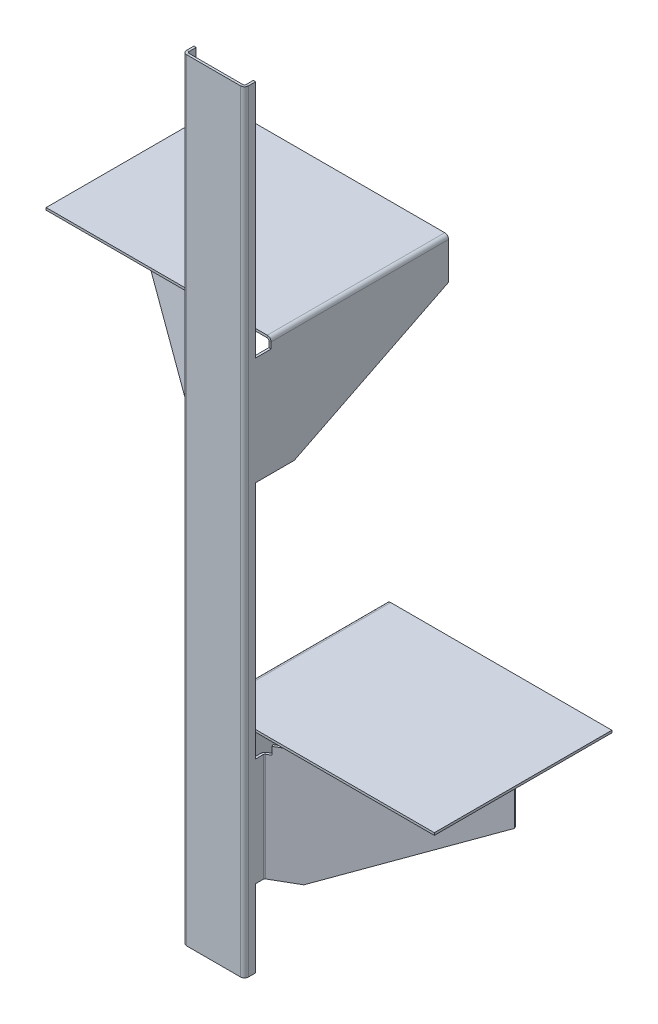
ISO-10303-21;
HEADER;
FILE_DESCRIPTION(('STEP AP214'),'2;1');
FILE_NAME('part.step','',(''),(''),'','','');
FILE_SCHEMA(('AUTOMOTIVE_DESIGN { 1 0 10303 214 1 1 1 1 }'));
ENDSEC;
DATA;
#1=APPLICATION_CONTEXT('core data for automotive mechanical design processes');
#2=APPLICATION_PROTOCOL_DEFINITION('international standard','automotive_design',2000,#1);
#3=PRODUCT_CONTEXT('',#1,'mechanical');
#4=PRODUCT('Part','Part','',(#3));
#5=PRODUCT_RELATED_PRODUCT_CATEGORY('part','',(#4));
#6=PRODUCT_DEFINITION_FORMATION('','',#4);
#7=PRODUCT_DEFINITION_CONTEXT('part definition',#1,'design');
#8=PRODUCT_DEFINITION('design','',#6,#7);
#9=PRODUCT_DEFINITION_SHAPE('','',#8);
#10=(LENGTH_UNIT() NAMED_UNIT(*) SI_UNIT(.MILLI.,.METRE.));
#11=(NAMED_UNIT(*) PLANE_ANGLE_UNIT() SI_UNIT($,.RADIAN.));
#12=(NAMED_UNIT(*) SI_UNIT($,.STERADIAN.) SOLID_ANGLE_UNIT());
#13=UNCERTAINTY_MEASURE_WITH_UNIT(LENGTH_MEASURE(1.E-05),#10,'distance_accuracy_value','');
#14=(GEOMETRIC_REPRESENTATION_CONTEXT(3) GLOBAL_UNCERTAINTY_ASSIGNED_CONTEXT((#13)) GLOBAL_UNIT_ASSIGNED_CONTEXT((#10,
#11,#12)) REPRESENTATION_CONTEXT('',''));
#15=CARTESIAN_POINT('',(0.,0.,0.));
#16=DIRECTION('',(0.,0.,1.));
#17=DIRECTION('',(1.,0.,0.));
#18=AXIS2_PLACEMENT_3D('',#15,#16,#17);
#19=CARTESIAN_POINT('',(-40.0000000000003,100.,88.4977871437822));
#20=DIRECTION('',(1.,0.,0.));
#21=DIRECTION('',(0.,0.,-1.));
#22=AXIS2_PLACEMENT_3D('',#19,#20,#21);
#23=PLANE('',#22);
#24=DIRECTION('',(0.,0.,-1.));
#25=VECTOR('',#24,1.);
#26=CARTESIAN_POINT('',(-40.,690.,-11.5022128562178));
#27=LINE('',#26,#25);
#28=CARTESIAN_POINT('',(-40.,690.,-11.5022128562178));
#29=VERTEX_POINT('',#28);
#30=CARTESIAN_POINT('',(-39.9999999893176,690.,-20.3475123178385));
#31=VERTEX_POINT('',#30);
#32=EDGE_CURVE('E61',#29,#31,#27,.T.);
#33=ORIENTED_EDGE('',*,*,#32,.T.);
#34=DIRECTION('',(0.,-1.,0.));
#35=VECTOR('',#34,1.);
#36=CARTESIAN_POINT('',(-40.,100.,-20.3475123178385));
#37=LINE('',#36,#35);
#38=CARTESIAN_POINT('',(-39.9999999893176,550.,-20.3475123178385));
#39=VERTEX_POINT('',#38);
#40=EDGE_CURVE('E880',#31,#39,#37,.T.);
#41=ORIENTED_EDGE('',*,*,#40,.T.);
#42=DIRECTION('',(0.,0.,1.));
#43=VECTOR('',#42,1.);
#44=CARTESIAN_POINT('',(-40.,550.,-11.5022128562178));
#45=LINE('',#44,#43);
#46=CARTESIAN_POINT('',(-40.,550.,-11.5022128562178));
#47=VERTEX_POINT('',#46);
#48=EDGE_CURVE('E742',#39,#47,#45,.T.);
#49=ORIENTED_EDGE('',*,*,#48,.T.);
#50=DIRECTION('',(0.,-1.,0.));
#51=VECTOR('',#50,1.);
#52=CARTESIAN_POINT('',(-40.,240.,-11.5022128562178));
#53=LINE('',#52,#51);
#54=CARTESIAN_POINT('',(-40.,240.,-11.5022128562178));
#55=VERTEX_POINT('',#54);
#56=EDGE_CURVE('E740',#47,#55,#53,.T.);
#57=ORIENTED_EDGE('',*,*,#56,.T.);
#58=DIRECTION('',(0.,0.,-1.));
#59=VECTOR('',#58,1.);
#60=CARTESIAN_POINT('',(-40.,240.,-11.5022128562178));
#61=LINE('',#60,#59);
#62=CARTESIAN_POINT('',(-39.9999999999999,240.,-31.5022128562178));
#63=VERTEX_POINT('',#62);
#64=EDGE_CURVE('E737',#55,#63,#61,.T.);
#65=ORIENTED_EDGE('',*,*,#64,.T.);
#66=DIRECTION('',(0.,1.,0.));
#67=VECTOR('',#66,1.);
#68=CARTESIAN_POINT('',(-39.9999999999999,240.,-31.5022128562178));
#69=LINE('',#68,#67);
#70=CARTESIAN_POINT('',(-39.9999999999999,248.,-31.5022128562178));
#71=VERTEX_POINT('',#70);
#72=EDGE_CURVE('E739',#63,#71,#69,.T.);
#73=ORIENTED_EDGE('',*,*,#72,.T.);
#74=DIRECTION('',(0.,0.,1.));
#75=VECTOR('',#74,1.);
#76=CARTESIAN_POINT('',(-40.0000000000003,248.,88.4977871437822));
#77=LINE('',#76,#75);
#78=CARTESIAN_POINT('',(-40.0000000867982,248.,-261.502212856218));
#79=VERTEX_POINT('',#78);
#80=EDGE_CURVE('E830',#79,#71,#77,.T.);
#81=ORIENTED_EDGE('',*,*,#80,.F.);
#82=DIRECTION('',(0.,-1.,0.));
#83=VECTOR('',#82,1.);
#84=CARTESIAN_POINT('',(-39.9999999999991,540.,-261.502212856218));
#85=LINE('',#84,#83);
#86=CARTESIAN_POINT('',(-39.9999999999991,200.,-261.502212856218));
#87=VERTEX_POINT('',#86);
#88=EDGE_CURVE('E736',#79,#87,#85,.T.);
#89=ORIENTED_EDGE('',*,*,#88,.T.);
#90=DIRECTION('',(0.,-0.447213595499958,0.894427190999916));
#91=VECTOR('',#90,1.);
#92=CARTESIAN_POINT('',(-39.9999999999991,200.,-261.502212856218));
#93=LINE('',#92,#91);
#94=CARTESIAN_POINT('',(-39.9999999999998,100.,-61.5022128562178));
#95=VERTEX_POINT('',#94);
#96=EDGE_CURVE('E734',#87,#95,#93,.T.);
#97=ORIENTED_EDGE('',*,*,#96,.T.);
#98=DIRECTION('',(0.,0.,1.));
#99=VECTOR('',#98,1.);
#100=CARTESIAN_POINT('',(-39.9999999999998,100.,-61.5022128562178));
#101=LINE('',#100,#99);
#102=CARTESIAN_POINT('',(-40.,100.,-11.5022128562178));
#103=VERTEX_POINT('',#102);
#104=EDGE_CURVE('E732',#95,#103,#101,.T.);
#105=ORIENTED_EDGE('',*,*,#104,.T.);
#106=DIRECTION('',(0.,-1.,0.));
#107=VECTOR('',#106,1.);
#108=CARTESIAN_POINT('',(-40.,0.,-11.5022128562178));
#109=LINE('',#108,#107);
#110=CARTESIAN_POINT('',(-40.,0.,-11.5022128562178));
#111=VERTEX_POINT('',#110);
#112=EDGE_CURVE('E730',#103,#111,#109,.T.);
#113=ORIENTED_EDGE('',*,*,#112,.T.);
#114=DIRECTION('',(0.,0.,1.));
#115=VECTOR('',#114,1.);
#116=CARTESIAN_POINT('',(-40.0000000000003,0.,88.4977871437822));
#117=LINE('',#116,#115);
#118=CARTESIAN_POINT('',(-40.0000000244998,0.,-2.00000000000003));
#119=VERTEX_POINT('',#118);
#120=EDGE_CURVE('E749',#111,#119,#117,.T.);
#121=ORIENTED_EDGE('',*,*,#120,.T.);
#122=DIRECTION('',(0.,1.,0.));
#123=VECTOR('',#122,1.);
#124=CARTESIAN_POINT('',(-40.,100.,-2.00000000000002));
#125=LINE('',#124,#123);
#126=CARTESIAN_POINT('',(-40.,1000.,-2.00000000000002));
#127=VERTEX_POINT('',#126);
#128=EDGE_CURVE('E747',#119,#127,#125,.T.);
#129=ORIENTED_EDGE('',*,*,#128,.T.);
#130=DIRECTION('',(0.,0.,-1.));
#131=VECTOR('',#130,1.);
#132=CARTESIAN_POINT('',(-40.0000000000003,1000.,88.4977871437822));
#133=LINE('',#132,#131);
#134=CARTESIAN_POINT('',(-40.,1000.,-11.5022128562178));
#135=VERTEX_POINT('',#134);
#136=EDGE_CURVE('E745',#127,#135,#133,.T.);
#137=ORIENTED_EDGE('',*,*,#136,.T.);
#138=DIRECTION('',(0.,-1.,0.));
#139=VECTOR('',#138,1.);
#140=CARTESIAN_POINT('',(-40.,690.,-11.5022128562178));
#141=LINE('',#140,#139);
#142=EDGE_CURVE('E743',#135,#29,#141,.T.);
#143=ORIENTED_EDGE('',*,*,#142,.T.);
#144=EDGE_LOOP('',(#33,#41,#49,#57,#65,#73,#81,#89,#97,#105,#113,#121,#129,#137,#143));
#145=FACE_BOUND('',#144,.T.);
#146=ADVANCED_FACE('F57',(#145),#23,.F.);
#147=CARTESIAN_POINT('',(-40.,690.,-11.5022128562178));
#148=DIRECTION('',(0.,-1.,0.));
#149=DIRECTION('',(1.,0.,0.));
#150=AXIS2_PLACEMENT_3D('',#147,#148,#149);
#151=PLANE('',#150);
#152=DIRECTION('',(0.,0.,-1.));
#153=VECTOR('',#152,1.);
#154=CARTESIAN_POINT('',(-37.,690.,-11.5022128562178));
#155=LINE('',#154,#153);
#156=CARTESIAN_POINT('',(-37.,690.,-11.5022128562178));
#157=VERTEX_POINT('',#156);
#158=CARTESIAN_POINT('',(-36.9999999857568,690.,-20.3475123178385));
#159=VERTEX_POINT('',#158);
#160=EDGE_CURVE('E760',#157,#159,#155,.T.);
#161=ORIENTED_EDGE('',*,*,#160,.T.);
#162=DIRECTION('',(-1.,0.,0.));
#163=VECTOR('',#162,1.);
#164=CARTESIAN_POINT('',(-40.,690.,-20.3475123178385));
#165=LINE('',#164,#163);
#166=EDGE_CURVE('E889',#159,#31,#165,.T.);
#167=ORIENTED_EDGE('',*,*,#166,.T.);
#168=ORIENTED_EDGE('',*,*,#32,.F.);
#169=DIRECTION('',(1.,0.,0.));
#170=VECTOR('',#169,1.);
#171=CARTESIAN_POINT('',(-40.,690.,-11.5022128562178));
#172=LINE('',#171,#170);
#173=EDGE_CURVE('E757',#29,#157,#172,.T.);
#174=ORIENTED_EDGE('',*,*,#173,.T.);
#175=EDGE_LOOP('',(#161,#167,#168,#174));
#176=FACE_BOUND('',#175,.T.);
#177=ADVANCED_FACE('F904',(#176),#151,.F.);
#178=CARTESIAN_POINT('',(-40.,550.,-11.5022128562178));
#179=DIRECTION('',(0.,1.,0.));
#180=DIRECTION('',(0.,0.,-1.));
#181=AXIS2_PLACEMENT_3D('',#178,#179,#180);
#182=PLANE('',#181);
#183=ORIENTED_EDGE('',*,*,#48,.F.);
#184=DIRECTION('',(1.,0.,0.));
#185=VECTOR('',#184,1.);
#186=CARTESIAN_POINT('',(-40.,550.,-20.3475123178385));
#187=LINE('',#186,#185);
#188=CARTESIAN_POINT('',(-37.,550.,-20.3475123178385));
#189=VERTEX_POINT('',#188);
#190=EDGE_CURVE('E12',#39,#189,#187,.T.);
#191=ORIENTED_EDGE('',*,*,#190,.T.);
#192=DIRECTION('',(0.,0.,1.));
#193=VECTOR('',#192,1.);
#194=CARTESIAN_POINT('',(-37.,550.,-11.5022128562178));
#195=LINE('',#194,#193);
#196=CARTESIAN_POINT('',(-37.,550.,-11.5022128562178));
#197=VERTEX_POINT('',#196);
#198=EDGE_CURVE('E764',#189,#197,#195,.T.);
#199=ORIENTED_EDGE('',*,*,#198,.T.);
#200=DIRECTION('',(1.,0.,0.));
#201=VECTOR('',#200,1.);
#202=CARTESIAN_POINT('',(-40.,550.,-11.5022128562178));
#203=LINE('',#202,#201);
#204=EDGE_CURVE('E761',#47,#197,#203,.T.);
#205=ORIENTED_EDGE('',*,*,#204,.F.);
#206=EDGE_LOOP('',(#183,#191,#199,#205));
#207=FACE_BOUND('',#206,.T.);
#208=ADVANCED_FACE('F59',(#207),#182,.F.);
#209=CARTESIAN_POINT('',(40.,100.,-11.5022128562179));
#210=DIRECTION('',(-1.,0.,0.));
#211=DIRECTION('',(0.,0.,1.));
#212=AXIS2_PLACEMENT_3D('',#209,#210,#211);
#213=PLANE('',#212);
#214=DIRECTION('',(0.,1.,0.));
#215=VECTOR('',#214,1.);
#216=CARTESIAN_POINT('',(39.9999999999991,650.,-261.502212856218));
#217=LINE('',#216,#215);
#218=CARTESIAN_POINT('',(39.9999999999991,650.,-261.502212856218));
#219=VERTEX_POINT('',#218);
#220=CARTESIAN_POINT('',(40.0000002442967,698.,-261.502212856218));
#221=VERTEX_POINT('',#220);
#222=EDGE_CURVE('E644',#219,#221,#217,.T.);
#223=ORIENTED_EDGE('',*,*,#222,.T.);
#224=DIRECTION('',(0.,0.,1.));
#225=VECTOR('',#224,1.);
#226=CARTESIAN_POINT('',(40.,698.,-11.5022128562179));
#227=LINE('',#226,#225);
#228=CARTESIAN_POINT('',(40.0000002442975,698.,-31.5022128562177));
#229=VERTEX_POINT('',#228);
#230=EDGE_CURVE('E866',#221,#229,#227,.T.);
#231=ORIENTED_EDGE('',*,*,#230,.T.);
#232=DIRECTION('',(0.,-1.,0.));
#233=VECTOR('',#232,1.);
#234=CARTESIAN_POINT('',(39.9999999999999,990.,-31.5022128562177));
#235=LINE('',#234,#233);
#236=CARTESIAN_POINT('',(39.9999999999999,690.,-31.5022128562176));
#237=VERTEX_POINT('',#236);
#238=EDGE_CURVE('E641',#229,#237,#235,.T.);
#239=ORIENTED_EDGE('',*,*,#238,.T.);
#240=DIRECTION('',(0.,0.,1.));
#241=VECTOR('',#240,1.);
#242=CARTESIAN_POINT('',(39.9999999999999,690.,-31.5022128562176));
#243=LINE('',#242,#241);
#244=CARTESIAN_POINT('',(40.,690.,-11.5022128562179));
#245=VERTEX_POINT('',#244);
#246=EDGE_CURVE('E639',#237,#245,#243,.T.);
#247=ORIENTED_EDGE('',*,*,#246,.T.);
#248=DIRECTION('',(0.,1.,0.));
#249=VECTOR('',#248,1.);
#250=CARTESIAN_POINT('',(40.,690.,-11.5022128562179));
#251=LINE('',#250,#249);
#252=CARTESIAN_POINT('',(40.,1000.,-11.5022128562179));
#253=VERTEX_POINT('',#252);
#254=EDGE_CURVE('E637',#245,#253,#251,.T.);
#255=ORIENTED_EDGE('',*,*,#254,.T.);
#256=DIRECTION('',(0.,0.,1.));
#257=VECTOR('',#256,1.);
#258=CARTESIAN_POINT('',(40.,1000.,-11.5022128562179));
#259=LINE('',#258,#257);
#260=CARTESIAN_POINT('',(40.0000000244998,1000.,-2.00000000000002));
#261=VERTEX_POINT('',#260);
#262=EDGE_CURVE('E634',#253,#261,#259,.T.);
#263=ORIENTED_EDGE('',*,*,#262,.T.);
#264=DIRECTION('',(0.,1.,0.));
#265=VECTOR('',#264,1.);
#266=CARTESIAN_POINT('',(40.,100.,-2.00000000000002));
#267=LINE('',#266,#265);
#268=CARTESIAN_POINT('',(40.,0.,-2.00000000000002));
#269=VERTEX_POINT('',#268);
#270=EDGE_CURVE('E618',#269,#261,#267,.T.);
#271=ORIENTED_EDGE('',*,*,#270,.F.);
#272=DIRECTION('',(0.,0.,-1.));
#273=VECTOR('',#272,1.);
#274=CARTESIAN_POINT('',(40.,0.,-11.5022128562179));
#275=LINE('',#274,#273);
#276=CARTESIAN_POINT('',(40.,0.,-11.5022128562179));
#277=VERTEX_POINT('',#276);
#278=EDGE_CURVE('E654',#269,#277,#275,.T.);
#279=ORIENTED_EDGE('',*,*,#278,.T.);
#280=DIRECTION('',(0.,1.,0.));
#281=VECTOR('',#280,1.);
#282=CARTESIAN_POINT('',(40.,0.,-11.5022128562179));
#283=LINE('',#282,#281);
#284=CARTESIAN_POINT('',(40.,100.,-11.5022128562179));
#285=VERTEX_POINT('',#284);
#286=EDGE_CURVE('E650',#277,#285,#283,.T.);
#287=ORIENTED_EDGE('',*,*,#286,.T.);
#288=DIRECTION('',(0.,0.,-1.));
#289=VECTOR('',#288,1.);
#290=CARTESIAN_POINT('',(40.,100.,-11.5022128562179));
#291=LINE('',#290,#289);
#292=CARTESIAN_POINT('',(39.9999999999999,100.,-21.5022128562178));
#293=VERTEX_POINT('',#292);
#294=EDGE_CURVE('E653',#285,#293,#291,.T.);
#295=ORIENTED_EDGE('',*,*,#294,.T.);
#296=DIRECTION('',(0.,-1.,0.));
#297=VECTOR('',#296,1.);
#298=CARTESIAN_POINT('',(39.9999999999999,100.,-21.5022128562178));
#299=LINE('',#298,#297);
#300=CARTESIAN_POINT('',(39.9999999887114,240.,-21.5022128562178));
#301=VERTEX_POINT('',#300);
#302=EDGE_CURVE('E850',#301,#293,#299,.T.);
#303=ORIENTED_EDGE('',*,*,#302,.F.);
#304=DIRECTION('',(0.,0.,1.));
#305=VECTOR('',#304,1.);
#306=CARTESIAN_POINT('',(39.9999999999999,240.,-31.5022128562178));
#307=LINE('',#306,#305);
#308=CARTESIAN_POINT('',(40.,240.,-11.5022128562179));
#309=VERTEX_POINT('',#308);
#310=EDGE_CURVE('E649',#301,#309,#307,.T.);
#311=ORIENTED_EDGE('',*,*,#310,.T.);
#312=DIRECTION('',(0.,1.,0.));
#313=VECTOR('',#312,1.);
#314=CARTESIAN_POINT('',(40.,240.,-11.5022128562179));
#315=LINE('',#314,#313);
#316=CARTESIAN_POINT('',(40.,550.,-11.5022128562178));
#317=VERTEX_POINT('',#316);
#318=EDGE_CURVE('E647',#309,#317,#315,.T.);
#319=ORIENTED_EDGE('',*,*,#318,.T.);
#320=DIRECTION('',(0.,0.,-1.));
#321=VECTOR('',#320,1.);
#322=CARTESIAN_POINT('',(40.,550.,-11.5022128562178));
#323=LINE('',#322,#321);
#324=CARTESIAN_POINT('',(39.9999999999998,550.,-61.5022128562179));
#325=VERTEX_POINT('',#324);
#326=EDGE_CURVE('E645',#317,#325,#323,.T.);
#327=ORIENTED_EDGE('',*,*,#326,.T.);
#328=DIRECTION('',(0.,0.447213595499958,-0.894427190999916));
#329=VECTOR('',#328,1.);
#330=CARTESIAN_POINT('',(39.9999999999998,550.,-61.5022128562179));
#331=LINE('',#330,#329);
#332=EDGE_CURVE('E642',#325,#219,#331,.T.);
#333=ORIENTED_EDGE('',*,*,#332,.T.);
#334=EDGE_LOOP('',(#223,#231,#239,#247,#255,#263,#271,#279,#287,#295,#303,#311,#319,#327,#333));
#335=FACE_BOUND('',#334,.T.);
#336=ADVANCED_FACE('F1084',(#335),#213,.F.);
#337=CARTESIAN_POINT('',(39.9999999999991,650.,-261.502212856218));
#338=DIRECTION('',(0.,0.,1.));
#339=DIRECTION('',(0.,-1.,0.));
#340=AXIS2_PLACEMENT_3D('',#337,#338,#339);
#341=PLANE('',#340);
#342=DIRECTION('',(0.,1.,0.));
#343=VECTOR('',#342,1.);
#344=CARTESIAN_POINT('',(36.9999999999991,650.,-261.502212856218));
#345=LINE('',#344,#343);
#346=CARTESIAN_POINT('',(36.9999999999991,650.,-261.502212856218));
#347=VERTEX_POINT('',#346);
#348=CARTESIAN_POINT('',(37.0000004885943,698.,-261.502212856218));
#349=VERTEX_POINT('',#348);
#350=EDGE_CURVE('E685',#347,#349,#345,.T.);
#351=ORIENTED_EDGE('',*,*,#350,.T.);
#352=DIRECTION('',(1.,0.,0.));
#353=VECTOR('',#352,1.);
#354=CARTESIAN_POINT('',(39.9999999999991,698.,-261.502212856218));
#355=LINE('',#354,#353);
#356=EDGE_CURVE('E873',#349,#221,#355,.T.);
#357=ORIENTED_EDGE('',*,*,#356,.T.);
#358=ORIENTED_EDGE('',*,*,#222,.F.);
#359=DIRECTION('',(-1.,0.,0.));
#360=VECTOR('',#359,1.);
#361=CARTESIAN_POINT('',(39.9999999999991,650.,-261.502212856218));
#362=LINE('',#361,#360);
#363=EDGE_CURVE('E682',#219,#347,#362,.T.);
#364=ORIENTED_EDGE('',*,*,#363,.T.);
#365=EDGE_LOOP('',(#351,#357,#358,#364));
#366=FACE_BOUND('',#365,.T.);
#367=ADVANCED_FACE('F1249',(#366),#341,.F.);
#368=CARTESIAN_POINT('',(39.9999999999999,990.,-31.5022128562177));
#369=DIRECTION('',(0.,0.,-1.));
#370=DIRECTION('',(0.,1.,0.));
#371=AXIS2_PLACEMENT_3D('',#368,#369,#370);
#372=PLANE('',#371);
#373=ORIENTED_EDGE('',*,*,#238,.F.);
#374=DIRECTION('',(-1.,0.,0.));
#375=VECTOR('',#374,1.);
#376=CARTESIAN_POINT('',(39.9999999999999,698.,-31.5022128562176));
#377=LINE('',#376,#375);
#378=CARTESIAN_POINT('',(36.9999999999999,698.,-31.5022128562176));
#379=VERTEX_POINT('',#378);
#380=EDGE_CURVE('E877',#229,#379,#377,.T.);
#381=ORIENTED_EDGE('',*,*,#380,.T.);
#382=DIRECTION('',(0.,-1.,0.));
#383=VECTOR('',#382,1.);
#384=CARTESIAN_POINT('',(36.9999999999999,990.,-31.5022128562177));
#385=LINE('',#384,#383);
#386=CARTESIAN_POINT('',(36.9999999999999,690.,-31.5022128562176));
#387=VERTEX_POINT('',#386);
#388=EDGE_CURVE('E689',#379,#387,#385,.T.);
#389=ORIENTED_EDGE('',*,*,#388,.T.);
#390=DIRECTION('',(-1.,0.,0.));
#391=VECTOR('',#390,1.);
#392=CARTESIAN_POINT('',(39.9999999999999,690.,-31.5022128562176));
#393=LINE('',#392,#391);
#394=EDGE_CURVE('E686',#237,#387,#393,.T.);
#395=ORIENTED_EDGE('',*,*,#394,.F.);
#396=EDGE_LOOP('',(#373,#381,#389,#395));
#397=FACE_BOUND('',#396,.T.);
#398=ADVANCED_FACE('F999',(#397),#372,.F.);
#399=CARTESIAN_POINT('',(37.,100.,-11.5022128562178));
#400=DIRECTION('',(-1.,0.,0.));
#401=DIRECTION('',(0.,0.,1.));
#402=AXIS2_PLACEMENT_3D('',#399,#400,#401);
#403=PLANE('',#402);
#404=DIRECTION('',(0.,0.,1.));
#405=VECTOR('',#404,1.);
#406=CARTESIAN_POINT('',(37.,698.,-11.5022128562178));
#407=LINE('',#406,#405);
#408=EDGE_CURVE('E81',#349,#379,#407,.T.);
#409=ORIENTED_EDGE('',*,*,#408,.F.);
#410=ORIENTED_EDGE('',*,*,#350,.F.);
#411=DIRECTION('',(0.,0.447213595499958,-0.894427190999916));
#412=VECTOR('',#411,1.);
#413=CARTESIAN_POINT('',(36.9999999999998,550.,-61.5022128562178));
#414=LINE('',#413,#412);
#415=CARTESIAN_POINT('',(36.9999999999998,550.,-61.5022128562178));
#416=VERTEX_POINT('',#415);
#417=EDGE_CURVE('E680',#416,#347,#414,.T.);
#418=ORIENTED_EDGE('',*,*,#417,.F.);
#419=DIRECTION('',(0.,0.,-1.));
#420=VECTOR('',#419,1.);
#421=CARTESIAN_POINT('',(37.,550.,-11.5022128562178));
#422=LINE('',#421,#420);
#423=CARTESIAN_POINT('',(37.,550.,-11.5022128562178));
#424=VERTEX_POINT('',#423);
#425=EDGE_CURVE('E675',#424,#416,#422,.T.);
#426=ORIENTED_EDGE('',*,*,#425,.F.);
#427=DIRECTION('',(0.,1.,0.));
#428=VECTOR('',#427,1.);
#429=CARTESIAN_POINT('',(37.,240.,-11.5022128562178));
#430=LINE('',#429,#428);
#431=CARTESIAN_POINT('',(37.,240.,-11.5022128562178));
#432=VERTEX_POINT('',#431);
#433=EDGE_CURVE('E670',#432,#424,#430,.T.);
#434=ORIENTED_EDGE('',*,*,#433,.F.);
#435=DIRECTION('',(0.,0.,1.));
#436=VECTOR('',#435,1.);
#437=CARTESIAN_POINT('',(36.9999999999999,240.,-31.5022128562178));
#438=LINE('',#437,#436);
#439=CARTESIAN_POINT('',(37.,240.,-21.5022128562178));
#440=VERTEX_POINT('',#439);
#441=EDGE_CURVE('E669',#440,#432,#438,.T.);
#442=ORIENTED_EDGE('',*,*,#441,.F.);
#443=DIRECTION('',(0.,-1.,0.));
#444=VECTOR('',#443,1.);
#445=CARTESIAN_POINT('',(37.,100.,-21.5022128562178));
#446=LINE('',#445,#444);
#447=CARTESIAN_POINT('',(37.,100.,-21.5022128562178));
#448=VERTEX_POINT('',#447);
#449=EDGE_CURVE('E860',#440,#448,#446,.T.);
#450=ORIENTED_EDGE('',*,*,#449,.T.);
#451=DIRECTION('',(0.,0.,-1.));
#452=VECTOR('',#451,1.);
#453=CARTESIAN_POINT('',(37.,100.,-11.5022128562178));
#454=LINE('',#453,#452);
#455=CARTESIAN_POINT('',(37.,100.,-11.5022128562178));
#456=VERTEX_POINT('',#455);
#457=EDGE_CURVE('E665',#456,#448,#454,.T.);
#458=ORIENTED_EDGE('',*,*,#457,.F.);
#459=DIRECTION('',(0.,1.,0.));
#460=VECTOR('',#459,1.);
#461=CARTESIAN_POINT('',(37.,0.,-11.5022128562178));
#462=LINE('',#461,#460);
#463=CARTESIAN_POINT('',(37.,0.,-11.5022128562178));
#464=VERTEX_POINT('',#463);
#465=EDGE_CURVE('E659',#464,#456,#462,.T.);
#466=ORIENTED_EDGE('',*,*,#465,.F.);
#467=DIRECTION('',(0.,0.,-1.));
#468=VECTOR('',#467,1.);
#469=CARTESIAN_POINT('',(37.,0.,-11.5022128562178));
#470=LINE('',#469,#468);
#471=CARTESIAN_POINT('',(37.,0.,-2.));
#472=VERTEX_POINT('',#471);
#473=EDGE_CURVE('E632',#472,#464,#470,.T.);
#474=ORIENTED_EDGE('',*,*,#473,.F.);
#475=DIRECTION('',(0.,1.,0.));
#476=VECTOR('',#475,1.);
#477=CARTESIAN_POINT('',(37.,100.,-2.));
#478=LINE('',#477,#476);
#479=CARTESIAN_POINT('',(37.,1000.,-2.));
#480=VERTEX_POINT('',#479);
#481=EDGE_CURVE('E629',#472,#480,#478,.T.);
#482=ORIENTED_EDGE('',*,*,#481,.T.);
#483=DIRECTION('',(0.,0.,1.));
#484=VECTOR('',#483,1.);
#485=CARTESIAN_POINT('',(37.,1000.,-11.5022128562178));
#486=LINE('',#485,#484);
#487=CARTESIAN_POINT('',(37.,1000.,-11.5022128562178));
#488=VERTEX_POINT('',#487);
#489=EDGE_CURVE('E623',#488,#480,#486,.T.);
#490=ORIENTED_EDGE('',*,*,#489,.F.);
#491=DIRECTION('',(0.,1.,0.));
#492=VECTOR('',#491,1.);
#493=CARTESIAN_POINT('',(37.,690.,-11.5022128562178));
#494=LINE('',#493,#492);
#495=CARTESIAN_POINT('',(37.,690.,-11.5022128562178));
#496=VERTEX_POINT('',#495);
#497=EDGE_CURVE('E695',#496,#488,#494,.T.);
#498=ORIENTED_EDGE('',*,*,#497,.F.);
#499=DIRECTION('',(0.,0.,1.));
#500=VECTOR('',#499,1.);
#501=CARTESIAN_POINT('',(36.9999999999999,690.,-31.5022128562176));
#502=LINE('',#501,#500);
#503=EDGE_CURVE('E690',#387,#496,#502,.T.);
#504=ORIENTED_EDGE('',*,*,#503,.F.);
#505=ORIENTED_EDGE('',*,*,#388,.F.);
#506=EDGE_LOOP('',(#409,#410,#418,#426,#434,#442,#450,#458,#466,#474,#482,#490,#498,#504,#505));
#507=FACE_BOUND('',#506,.T.);
#508=ADVANCED_FACE('F1004',(#507),#403,.T.);
#509=CARTESIAN_POINT('',(-37.0000000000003,100.,88.4977871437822));
#510=DIRECTION('',(1.,0.,0.));
#511=DIRECTION('',(0.,0.,-1.));
#512=AXIS2_PLACEMENT_3D('',#509,#510,#511);
#513=PLANE('',#512);
#514=DIRECTION('',(0.,-1.,0.));
#515=VECTOR('',#514,1.);
#516=CARTESIAN_POINT('',(-37.,100.,-20.3475123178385));
#517=LINE('',#516,#515);
#518=EDGE_CURVE('E66',#159,#189,#517,.T.);
#519=ORIENTED_EDGE('',*,*,#518,.F.);
#520=ORIENTED_EDGE('',*,*,#160,.F.);
#521=DIRECTION('',(0.,-1.,0.));
#522=VECTOR('',#521,1.);
#523=CARTESIAN_POINT('',(-37.,690.,-11.5022128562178));
#524=LINE('',#523,#522);
#525=CARTESIAN_POINT('',(-37.,1000.,-11.5022128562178));
#526=VERTEX_POINT('',#525);
#527=EDGE_CURVE('E755',#526,#157,#524,.T.);
#528=ORIENTED_EDGE('',*,*,#527,.F.);
#529=DIRECTION('',(0.,0.,-1.));
#530=VECTOR('',#529,1.);
#531=CARTESIAN_POINT('',(-37.0000000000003,1000.,88.4977871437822));
#532=LINE('',#531,#530);
#533=CARTESIAN_POINT('',(-37.,1000.,-2.));
#534=VERTEX_POINT('',#533);
#535=EDGE_CURVE('E725',#534,#526,#532,.T.);
#536=ORIENTED_EDGE('',*,*,#535,.F.);
#537=DIRECTION('',(0.,1.,0.));
#538=VECTOR('',#537,1.);
#539=CARTESIAN_POINT('',(-37.,100.,-2.));
#540=LINE('',#539,#538);
#541=CARTESIAN_POINT('',(-37.,0.,-2.));
#542=VERTEX_POINT('',#541);
#543=EDGE_CURVE('E712',#542,#534,#540,.T.);
#544=ORIENTED_EDGE('',*,*,#543,.F.);
#545=DIRECTION('',(0.,0.,1.));
#546=VECTOR('',#545,1.);
#547=CARTESIAN_POINT('',(-37.0000000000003,0.,88.4977871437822));
#548=LINE('',#547,#546);
#549=CARTESIAN_POINT('',(-37.,0.,-11.5022128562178));
#550=VERTEX_POINT('',#549);
#551=EDGE_CURVE('E723',#550,#542,#548,.T.);
#552=ORIENTED_EDGE('',*,*,#551,.F.);
#553=DIRECTION('',(0.,-1.,0.));
#554=VECTOR('',#553,1.);
#555=CARTESIAN_POINT('',(-37.,0.,-11.5022128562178));
#556=LINE('',#555,#554);
#557=CARTESIAN_POINT('',(-37.,100.,-11.5022128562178));
#558=VERTEX_POINT('',#557);
#559=EDGE_CURVE('E790',#558,#550,#556,.T.);
#560=ORIENTED_EDGE('',*,*,#559,.F.);
#561=DIRECTION('',(0.,0.,1.));
#562=VECTOR('',#561,1.);
#563=CARTESIAN_POINT('',(-36.9999999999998,100.,-61.5022128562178));
#564=LINE('',#563,#562);
#565=CARTESIAN_POINT('',(-36.9999999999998,100.,-61.5022128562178));
#566=VERTEX_POINT('',#565);
#567=EDGE_CURVE('E785',#566,#558,#564,.T.);
#568=ORIENTED_EDGE('',*,*,#567,.F.);
#569=DIRECTION('',(0.,-0.447213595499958,0.894427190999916));
#570=VECTOR('',#569,1.);
#571=CARTESIAN_POINT('',(-36.9999999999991,200.,-261.502212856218));
#572=LINE('',#571,#570);
#573=CARTESIAN_POINT('',(-36.9999999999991,200.,-261.502212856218));
#574=VERTEX_POINT('',#573);
#575=EDGE_CURVE('E780',#574,#566,#572,.T.);
#576=ORIENTED_EDGE('',*,*,#575,.F.);
#577=DIRECTION('',(0.,-1.,0.));
#578=VECTOR('',#577,1.);
#579=CARTESIAN_POINT('',(-36.9999999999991,540.,-261.502212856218));
#580=LINE('',#579,#578);
#581=CARTESIAN_POINT('',(-36.9999999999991,248.,-261.502212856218));
#582=VERTEX_POINT('',#581);
#583=EDGE_CURVE('E779',#582,#574,#580,.T.);
#584=ORIENTED_EDGE('',*,*,#583,.F.);
#585=DIRECTION('',(0.,0.,1.));
#586=VECTOR('',#585,1.);
#587=CARTESIAN_POINT('',(-37.0000000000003,248.,88.4977871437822));
#588=LINE('',#587,#586);
#589=CARTESIAN_POINT('',(-36.9999999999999,248.,-31.5022128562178));
#590=VERTEX_POINT('',#589);
#591=EDGE_CURVE('E844',#582,#590,#588,.T.);
#592=ORIENTED_EDGE('',*,*,#591,.T.);
#593=DIRECTION('',(0.,1.,0.));
#594=VECTOR('',#593,1.);
#595=CARTESIAN_POINT('',(-36.9999999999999,240.,-31.5022128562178));
#596=LINE('',#595,#594);
#597=CARTESIAN_POINT('',(-36.9999999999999,240.,-31.5022128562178));
#598=VERTEX_POINT('',#597);
#599=EDGE_CURVE('E775',#598,#590,#596,.T.);
#600=ORIENTED_EDGE('',*,*,#599,.F.);
#601=DIRECTION('',(0.,0.,-1.));
#602=VECTOR('',#601,1.);
#603=CARTESIAN_POINT('',(-37.,240.,-11.5022128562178));
#604=LINE('',#603,#602);
#605=CARTESIAN_POINT('',(-37.,240.,-11.5022128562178));
#606=VERTEX_POINT('',#605);
#607=EDGE_CURVE('E770',#606,#598,#604,.T.);
#608=ORIENTED_EDGE('',*,*,#607,.F.);
#609=DIRECTION('',(0.,-1.,0.));
#610=VECTOR('',#609,1.);
#611=CARTESIAN_POINT('',(-37.,240.,-11.5022128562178));
#612=LINE('',#611,#610);
#613=EDGE_CURVE('E765',#197,#606,#612,.T.);
#614=ORIENTED_EDGE('',*,*,#613,.F.);
#615=ORIENTED_EDGE('',*,*,#198,.F.);
#616=EDGE_LOOP('',(#519,#520,#528,#536,#544,#552,#560,#568,#576,#584,#592,#600,#608,#614,#615));
#617=FACE_BOUND('',#616,.T.);
#618=ADVANCED_FACE('F1001',(#617),#513,.T.);
#619=CARTESIAN_POINT('',(50.,100.,3.));
#620=DIRECTION('',(0.,0.,-1.));
#621=DIRECTION('',(-1.,0.,0.));
#622=AXIS2_PLACEMENT_3D('',#619,#620,#621);
#623=PLANE('',#622);
#624=DIRECTION('',(1.,0.,0.));
#625=VECTOR('',#624,1.);
#626=CARTESIAN_POINT('',(50.,0.,3.));
#627=LINE('',#626,#625);
#628=CARTESIAN_POINT('',(-35.,0.,3.00000001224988));
#629=VERTEX_POINT('',#628);
#630=CARTESIAN_POINT('',(35.,0.,3.00000001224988));
#631=VERTEX_POINT('',#630);
#632=EDGE_CURVE('E810',#629,#631,#627,.T.);
#633=ORIENTED_EDGE('',*,*,#632,.T.);
#634=DIRECTION('',(0.,1.,0.));
#635=VECTOR('',#634,1.);
#636=CARTESIAN_POINT('',(35.,100.,3.));
#637=LINE('',#636,#635);
#638=CARTESIAN_POINT('',(35.,1000.,3.00000001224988));
#639=VERTEX_POINT('',#638);
#640=EDGE_CURVE('E819',#631,#639,#637,.T.);
#641=ORIENTED_EDGE('',*,*,#640,.T.);
#642=DIRECTION('',(-1.,0.,0.));
#643=VECTOR('',#642,1.);
#644=CARTESIAN_POINT('',(50.,1000.,3.));
#645=LINE('',#644,#643);
#646=CARTESIAN_POINT('',(-35.,1000.,3.));
#647=VERTEX_POINT('',#646);
#648=EDGE_CURVE('E835',#639,#647,#645,.T.);
#649=ORIENTED_EDGE('',*,*,#648,.T.);
#650=DIRECTION('',(0.,1.,0.));
#651=VECTOR('',#650,1.);
#652=CARTESIAN_POINT('',(-35.,100.,3.));
#653=LINE('',#652,#651);
#654=EDGE_CURVE('E806',#629,#647,#653,.T.);
#655=ORIENTED_EDGE('',*,*,#654,.F.);
#656=EDGE_LOOP('',(#633,#641,#649,#655));
#657=FACE_BOUND('',#656,.T.);
#658=ADVANCED_FACE('F1003',(#657),#623,.F.);
#659=CARTESIAN_POINT('',(50.,0.,3.));
#660=DIRECTION('',(0.,1.,0.));
#661=DIRECTION('',(0.,0.,1.));
#662=AXIS2_PLACEMENT_3D('',#659,#660,#661);
#663=PLANE('',#662);
#664=DIRECTION('',(1.,0.,0.));
#665=VECTOR('',#664,1.);
#666=CARTESIAN_POINT('',(50.,0.,0.));
#667=LINE('',#666,#665);
#668=CARTESIAN_POINT('',(-35.,0.,0.));
#669=VERTEX_POINT('',#668);
#670=CARTESIAN_POINT('',(35.,0.,2.44997563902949E-08));
#671=VERTEX_POINT('',#670);
#672=EDGE_CURVE('E832',#669,#671,#667,.T.);
#673=ORIENTED_EDGE('',*,*,#672,.T.);
#674=DIRECTION('',(0.,0.,1.));
#675=VECTOR('',#674,1.);
#676=CARTESIAN_POINT('',(35.,0.,3.));
#677=LINE('',#676,#675);
#678=EDGE_CURVE('E822',#671,#631,#677,.T.);
#679=ORIENTED_EDGE('',*,*,#678,.T.);
#680=ORIENTED_EDGE('',*,*,#632,.F.);
#681=DIRECTION('',(0.,0.,1.));
#682=VECTOR('',#681,1.);
#683=CARTESIAN_POINT('',(-35.,0.,3.));
#684=LINE('',#683,#682);
#685=EDGE_CURVE('E816',#669,#629,#684,.T.);
#686=ORIENTED_EDGE('',*,*,#685,.F.);
#687=EDGE_LOOP('',(#673,#679,#680,#686));
#688=FACE_BOUND('',#687,.T.);
#689=ADVANCED_FACE('F1010',(#688),#663,.F.);
#690=CARTESIAN_POINT('',(50.,1000.,3.));
#691=DIRECTION('',(0.,-1.,0.));
#692=DIRECTION('',(0.,0.,-1.));
#693=AXIS2_PLACEMENT_3D('',#690,#691,#692);
#694=PLANE('',#693);
#695=ORIENTED_EDGE('',*,*,#648,.F.);
#696=DIRECTION('',(0.,0.,-1.));
#697=VECTOR('',#696,1.);
#698=CARTESIAN_POINT('',(35.,1000.,3.));
#699=LINE('',#698,#697);
#700=CARTESIAN_POINT('',(35.,1000.,0.));
#701=VERTEX_POINT('',#700);
#702=EDGE_CURVE('E827',#639,#701,#699,.T.);
#703=ORIENTED_EDGE('',*,*,#702,.T.);
#704=DIRECTION('',(-1.,0.,0.));
#705=VECTOR('',#704,1.);
#706=CARTESIAN_POINT('',(50.,1000.,0.));
#707=LINE('',#706,#705);
#708=CARTESIAN_POINT('',(-35.,1000.,0.));
#709=VERTEX_POINT('',#708);
#710=EDGE_CURVE('E801',#701,#709,#707,.T.);
#711=ORIENTED_EDGE('',*,*,#710,.T.);
#712=DIRECTION('',(0.,0.,-1.));
#713=VECTOR('',#712,1.);
#714=CARTESIAN_POINT('',(-35.,1000.,3.));
#715=LINE('',#714,#713);
#716=EDGE_CURVE('E809',#647,#709,#715,.T.);
#717=ORIENTED_EDGE('',*,*,#716,.F.);
#718=EDGE_LOOP('',(#695,#703,#711,#717));
#719=FACE_BOUND('',#718,.T.);
#720=ADVANCED_FACE('F1063',(#719),#694,.F.);
#721=CARTESIAN_POINT('',(50.,100.,0.));
#722=DIRECTION('',(0.,0.,-1.));
#723=DIRECTION('',(-1.,0.,0.));
#724=AXIS2_PLACEMENT_3D('',#721,#722,#723);
#725=PLANE('',#724);
#726=DIRECTION('',(0.,1.,0.));
#727=VECTOR('',#726,1.);
#728=CARTESIAN_POINT('',(35.,100.,0.));
#729=LINE('',#728,#727);
#730=EDGE_CURVE('E825',#671,#701,#729,.T.);
#731=ORIENTED_EDGE('',*,*,#730,.F.);
#732=ORIENTED_EDGE('',*,*,#672,.F.);
#733=DIRECTION('',(0.,1.,0.));
#734=VECTOR('',#733,1.);
#735=CARTESIAN_POINT('',(-35.,100.,0.));
#736=LINE('',#735,#734);
#737=EDGE_CURVE('E813',#669,#709,#736,.T.);
#738=ORIENTED_EDGE('',*,*,#737,.T.);
#739=ORIENTED_EDGE('',*,*,#710,.F.);
#740=EDGE_LOOP('',(#731,#732,#738,#739));
#741=FACE_BOUND('',#740,.T.);
#742=ADVANCED_FACE('F1056',(#741),#725,.T.);
#743=CARTESIAN_POINT('',(-35.,0.,-2.00000002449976));
#744=DIRECTION('',(0.,-1.,0.));
#745=DIRECTION('',(0.,0.,-1.));
#746=AXIS2_PLACEMENT_3D('',#743,#744,#745);
#747=PLANE('',#746);
#748=DIRECTION('',(-1.,0.,0.));
#749=VECTOR('',#748,1.);
#750=CARTESIAN_POINT('',(-40.,0.,-2.00000000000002));
#751=LINE('',#750,#749);
#752=EDGE_CURVE('E721',#542,#119,#751,.T.);
#753=ORIENTED_EDGE('',*,*,#752,.F.);
#754=CARTESIAN_POINT('',(-35.,0.,-2.));
#755=DIRECTION('',(0.,-1.,0.));
#756=DIRECTION('',(0.,0.,-1.));
#757=AXIS2_PLACEMENT_3D('',#754,#755,#756);
#758=CIRCLE('',#757,2.00000002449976);
#759=EDGE_CURVE('E720',#542,#669,#758,.F.);
#760=ORIENTED_EDGE('',*,*,#759,.T.);
#761=ORIENTED_EDGE('',*,*,#685,.T.);
#762=CARTESIAN_POINT('',(-35.,0.,-2.00000002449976));
#763=DIRECTION('',(0.,1.,0.));
#764=DIRECTION('',(0.,0.,1.));
#765=AXIS2_PLACEMENT_3D('',#762,#763,#764);
#766=CIRCLE('',#765,5.00000003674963);
#767=EDGE_CURVE('E794',#119,#629,#766,.T.);
#768=ORIENTED_EDGE('',*,*,#767,.F.);
#769=EDGE_LOOP('',(#753,#760,#761,#768));
#770=FACE_BOUND('',#769,.T.);
#771=ADVANCED_FACE('F1044',(#770),#747,.T.);
#772=CARTESIAN_POINT('',(-35.,1000.,-2.00000002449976));
#773=DIRECTION('',(0.,1.,0.));
#774=DIRECTION('',(0.,0.,1.));
#775=AXIS2_PLACEMENT_3D('',#772,#773,#774);
#776=PLANE('',#775);
#777=CARTESIAN_POINT('',(-35.,1000.,-2.));
#778=DIRECTION('',(0.,-1.,0.));
#779=DIRECTION('',(0.,0.,-1.));
#780=AXIS2_PLACEMENT_3D('',#777,#778,#779);
#781=CIRCLE('',#780,2.00000002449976);
#782=EDGE_CURVE('E798',#709,#534,#781,.T.);
#783=ORIENTED_EDGE('',*,*,#782,.T.);
#784=DIRECTION('',(1.,0.,0.));
#785=VECTOR('',#784,1.);
#786=CARTESIAN_POINT('',(-40.,1000.,-2.00000000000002));
#787=LINE('',#786,#785);
#788=EDGE_CURVE('E727',#127,#534,#787,.T.);
#789=ORIENTED_EDGE('',*,*,#788,.F.);
#790=CARTESIAN_POINT('',(-35.,1000.,-2.00000002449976));
#791=DIRECTION('',(0.,-1.,0.));
#792=DIRECTION('',(0.,0.,-1.));
#793=AXIS2_PLACEMENT_3D('',#790,#791,#792);
#794=CIRCLE('',#793,5.00000003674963);
#795=EDGE_CURVE('E797',#647,#127,#794,.T.);
#796=ORIENTED_EDGE('',*,*,#795,.F.);
#797=ORIENTED_EDGE('',*,*,#716,.T.);
#798=EDGE_LOOP('',(#783,#789,#796,#797));
#799=FACE_BOUND('',#798,.T.);
#800=ADVANCED_FACE('F1059',(#799),#776,.T.);
#801=CARTESIAN_POINT('',(-35.,1500.01961263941,-2.));
#802=DIRECTION('',(0.,-1.,0.));
#803=DIRECTION('',(0.,0.,-1.));
#804=AXIS2_PLACEMENT_3D('',#801,#802,#803);
#805=CYLINDRICAL_SURFACE('',#804,5.00000002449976);
#806=ORIENTED_EDGE('',*,*,#654,.T.);
#807=ORIENTED_EDGE('',*,*,#795,.T.);
#808=ORIENTED_EDGE('',*,*,#128,.F.);
#809=ORIENTED_EDGE('',*,*,#767,.T.);
#810=EDGE_LOOP('',(#806,#807,#808,#809));
#811=FACE_BOUND('',#810,.T.);
#812=ADVANCED_FACE('F1040',(#811),#805,.T.);
#813=CARTESIAN_POINT('',(-35.,1500.01961263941,-2.));
#814=DIRECTION('',(0.,-1.,0.));
#815=DIRECTION('',(0.,0.,-1.));
#816=AXIS2_PLACEMENT_3D('',#813,#814,#815);
#817=CYLINDRICAL_SURFACE('',#816,2.00000002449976);
#818=ORIENTED_EDGE('',*,*,#737,.F.);
#819=ORIENTED_EDGE('',*,*,#759,.F.);
#820=ORIENTED_EDGE('',*,*,#543,.T.);
#821=ORIENTED_EDGE('',*,*,#782,.F.);
#822=EDGE_LOOP('',(#818,#819,#820,#821));
#823=FACE_BOUND('',#822,.T.);
#824=ADVANCED_FACE('F1053',(#823),#817,.F.);
#825=CARTESIAN_POINT('',(-40.,0.,-11.5022128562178));
#826=DIRECTION('',(0.,0.,1.));
#827=DIRECTION('',(1.,0.,0.));
#828=AXIS2_PLACEMENT_3D('',#825,#826,#827);
#829=PLANE('',#828);
#830=ORIENTED_EDGE('',*,*,#559,.T.);
#831=DIRECTION('',(1.,0.,0.));
#832=VECTOR('',#831,1.);
#833=CARTESIAN_POINT('',(-40.,0.,-11.5022128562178));
#834=LINE('',#833,#832);
#835=EDGE_CURVE('E717',#111,#550,#834,.T.);
#836=ORIENTED_EDGE('',*,*,#835,.F.);
#837=ORIENTED_EDGE('',*,*,#112,.F.);
#838=DIRECTION('',(1.,0.,0.));
#839=VECTOR('',#838,1.);
#840=CARTESIAN_POINT('',(-40.,100.,-11.5022128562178));
#841=LINE('',#840,#839);
#842=EDGE_CURVE('E787',#103,#558,#841,.T.);
#843=ORIENTED_EDGE('',*,*,#842,.T.);
#844=EDGE_LOOP('',(#830,#836,#837,#843));
#845=FACE_BOUND('',#844,.T.);
#846=ADVANCED_FACE('F1033',(#845),#829,.F.);
#847=CARTESIAN_POINT('',(-39.9999999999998,100.,-61.5022128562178));
#848=DIRECTION('',(0.,1.,0.));
#849=DIRECTION('',(-1.,0.,0.));
#850=AXIS2_PLACEMENT_3D('',#847,#848,#849);
#851=PLANE('',#850);
#852=ORIENTED_EDGE('',*,*,#567,.T.);
#853=ORIENTED_EDGE('',*,*,#842,.F.);
#854=ORIENTED_EDGE('',*,*,#104,.F.);
#855=DIRECTION('',(1.,0.,0.));
#856=VECTOR('',#855,1.);
#857=CARTESIAN_POINT('',(-39.9999999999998,100.,-61.5022128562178));
#858=LINE('',#857,#856);
#859=EDGE_CURVE('E782',#95,#566,#858,.T.);
#860=ORIENTED_EDGE('',*,*,#859,.T.);
#861=EDGE_LOOP('',(#852,#853,#854,#860));
#862=FACE_BOUND('',#861,.T.);
#863=ADVANCED_FACE('F1028',(#862),#851,.F.);
#864=CARTESIAN_POINT('',(-39.9999999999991,200.,-261.502212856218));
#865=DIRECTION('',(0.,0.894427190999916,0.447213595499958));
#866=DIRECTION('',(0.,0.447213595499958,-0.894427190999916));
#867=AXIS2_PLACEMENT_3D('',#864,#865,#866);
#868=PLANE('',#867);
#869=ORIENTED_EDGE('',*,*,#575,.T.);
#870=ORIENTED_EDGE('',*,*,#859,.F.);
#871=ORIENTED_EDGE('',*,*,#96,.F.);
#872=DIRECTION('',(1.,0.,0.));
#873=VECTOR('',#872,1.);
#874=CARTESIAN_POINT('',(-39.9999999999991,200.,-261.502212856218));
#875=LINE('',#874,#873);
#876=EDGE_CURVE('E776',#87,#574,#875,.T.);
#877=ORIENTED_EDGE('',*,*,#876,.T.);
#878=EDGE_LOOP('',(#869,#870,#871,#877));
#879=FACE_BOUND('',#878,.T.);
#880=ADVANCED_FACE('F1026',(#879),#868,.F.);
#881=CARTESIAN_POINT('',(-39.9999999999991,540.,-261.502212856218));
#882=DIRECTION('',(0.,0.,1.));
#883=DIRECTION('',(1.,0.,0.));
#884=AXIS2_PLACEMENT_3D('',#881,#882,#883);
#885=PLANE('',#884);
#886=DIRECTION('',(-1.,0.,0.));
#887=VECTOR('',#886,1.);
#888=CARTESIAN_POINT('',(-39.9999999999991,248.,-261.502212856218));
#889=LINE('',#888,#887);
#890=EDGE_CURVE('E847',#582,#79,#889,.T.);
#891=ORIENTED_EDGE('',*,*,#890,.F.);
#892=ORIENTED_EDGE('',*,*,#583,.T.);
#893=ORIENTED_EDGE('',*,*,#876,.F.);
#894=ORIENTED_EDGE('',*,*,#88,.F.);
#895=EDGE_LOOP('',(#891,#892,#893,#894));
#896=FACE_BOUND('',#895,.T.);
#897=ADVANCED_FACE('F1020',(#896),#885,.F.);
#898=CARTESIAN_POINT('',(-39.9999999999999,240.,-31.5022128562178));
#899=DIRECTION('',(0.,0.,-1.));
#900=DIRECTION('',(-1.,0.,0.));
#901=AXIS2_PLACEMENT_3D('',#898,#899,#900);
#902=PLANE('',#901);
#903=DIRECTION('',(1.,0.,0.));
#904=VECTOR('',#903,1.);
#905=CARTESIAN_POINT('',(-39.9999999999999,248.,-31.5022128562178));
#906=LINE('',#905,#904);
#907=EDGE_CURVE('E841',#71,#590,#906,.T.);
#908=ORIENTED_EDGE('',*,*,#907,.F.);
#909=ORIENTED_EDGE('',*,*,#72,.F.);
#910=DIRECTION('',(1.,0.,0.));
#911=VECTOR('',#910,1.);
#912=CARTESIAN_POINT('',(-39.9999999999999,240.,-31.5022128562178));
#913=LINE('',#912,#911);
#914=EDGE_CURVE('E772',#63,#598,#913,.T.);
#915=ORIENTED_EDGE('',*,*,#914,.T.);
#916=ORIENTED_EDGE('',*,*,#599,.T.);
#917=EDGE_LOOP('',(#908,#909,#915,#916));
#918=FACE_BOUND('',#917,.T.);
#919=ADVANCED_FACE('F948',(#918),#902,.F.);
#920=CARTESIAN_POINT('',(-40.,240.,-11.5022128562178));
#921=DIRECTION('',(0.,-1.,0.));
#922=DIRECTION('',(1.,0.,0.));
#923=AXIS2_PLACEMENT_3D('',#920,#921,#922);
#924=PLANE('',#923);
#925=ORIENTED_EDGE('',*,*,#607,.T.);
#926=ORIENTED_EDGE('',*,*,#914,.F.);
#927=ORIENTED_EDGE('',*,*,#64,.F.);
#928=DIRECTION('',(1.,0.,0.));
#929=VECTOR('',#928,1.);
#930=CARTESIAN_POINT('',(-40.,240.,-11.5022128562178));
#931=LINE('',#930,#929);
#932=EDGE_CURVE('E767',#55,#606,#931,.T.);
#933=ORIENTED_EDGE('',*,*,#932,.T.);
#934=EDGE_LOOP('',(#925,#926,#927,#933));
#935=FACE_BOUND('',#934,.T.);
#936=ADVANCED_FACE('F944',(#935),#924,.F.);
#937=CARTESIAN_POINT('',(-40.,240.,-11.5022128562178));
#938=DIRECTION('',(0.,0.,1.));
#939=DIRECTION('',(0.,1.,0.));
#940=AXIS2_PLACEMENT_3D('',#937,#938,#939);
#941=PLANE('',#940);
#942=ORIENTED_EDGE('',*,*,#613,.T.);
#943=ORIENTED_EDGE('',*,*,#932,.F.);
#944=ORIENTED_EDGE('',*,*,#56,.F.);
#945=ORIENTED_EDGE('',*,*,#204,.T.);
#946=EDGE_LOOP('',(#942,#943,#944,#945));
#947=FACE_BOUND('',#946,.T.);
#948=ADVANCED_FACE('F937',(#947),#941,.F.);
#949=CARTESIAN_POINT('',(-40.,690.,-11.5022128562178));
#950=DIRECTION('',(0.,0.,1.));
#951=DIRECTION('',(1.,0.,0.));
#952=AXIS2_PLACEMENT_3D('',#949,#950,#951);
#953=PLANE('',#952);
#954=ORIENTED_EDGE('',*,*,#527,.T.);
#955=ORIENTED_EDGE('',*,*,#173,.F.);
#956=ORIENTED_EDGE('',*,*,#142,.F.);
#957=DIRECTION('',(1.,0.,0.));
#958=VECTOR('',#957,1.);
#959=CARTESIAN_POINT('',(-40.,1000.,-11.5022128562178));
#960=LINE('',#959,#958);
#961=EDGE_CURVE('E752',#135,#526,#960,.T.);
#962=ORIENTED_EDGE('',*,*,#961,.T.);
#963=EDGE_LOOP('',(#954,#955,#956,#962));
#964=FACE_BOUND('',#963,.T.);
#965=ADVANCED_FACE('F1829',(#964),#953,.F.);
#966=CARTESIAN_POINT('',(-40.0000000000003,1000.,88.4977871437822));
#967=DIRECTION('',(0.,-1.,0.));
#968=DIRECTION('',(1.,0.,0.));
#969=AXIS2_PLACEMENT_3D('',#966,#967,#968);
#970=PLANE('',#969);
#971=ORIENTED_EDGE('',*,*,#136,.F.);
#972=ORIENTED_EDGE('',*,*,#788,.T.);
#973=ORIENTED_EDGE('',*,*,#535,.T.);
#974=ORIENTED_EDGE('',*,*,#961,.F.);
#975=EDGE_LOOP('',(#971,#972,#973,#974));
#976=FACE_BOUND('',#975,.T.);
#977=ADVANCED_FACE('F1819',(#976),#970,.F.);
#978=CARTESIAN_POINT('',(-40.0000000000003,0.,88.4977871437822));
#979=DIRECTION('',(0.,1.,0.));
#980=DIRECTION('',(-1.,0.,0.));
#981=AXIS2_PLACEMENT_3D('',#978,#979,#980);
#982=PLANE('',#981);
#983=ORIENTED_EDGE('',*,*,#551,.T.);
#984=ORIENTED_EDGE('',*,*,#752,.T.);
#985=ORIENTED_EDGE('',*,*,#120,.F.);
#986=ORIENTED_EDGE('',*,*,#835,.T.);
#987=EDGE_LOOP('',(#983,#984,#985,#986));
#988=FACE_BOUND('',#987,.T.);
#989=ADVANCED_FACE('F1809',(#988),#982,.F.);
#990=CARTESIAN_POINT('',(35.,0.,-2.00000002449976));
#991=DIRECTION('',(0.,-1.,0.));
#992=DIRECTION('',(0.,0.,-1.));
#993=AXIS2_PLACEMENT_3D('',#990,#991,#992);
#994=PLANE('',#993);
#995=ORIENTED_EDGE('',*,*,#678,.F.);
#996=CARTESIAN_POINT('',(35.,0.,-2.));
#997=DIRECTION('',(0.,1.,0.));
#998=DIRECTION('',(0.,0.,1.));
#999=AXIS2_PLACEMENT_3D('',#996,#997,#998);
#1000=CIRCLE('',#999,2.00000002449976);
#1001=EDGE_CURVE('E625',#671,#472,#1000,.T.);
#1002=ORIENTED_EDGE('',*,*,#1001,.T.);
#1003=DIRECTION('',(1.,0.,0.));
#1004=VECTOR('',#1003,1.);
#1005=CARTESIAN_POINT('',(40.,0.,-2.00000000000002));
#1006=LINE('',#1005,#1004);
#1007=EDGE_CURVE('E697',#472,#269,#1006,.T.);
#1008=ORIENTED_EDGE('',*,*,#1007,.T.);
#1009=CARTESIAN_POINT('',(35.,0.,-2.00000002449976));
#1010=DIRECTION('',(0.,1.,0.));
#1011=DIRECTION('',(0.,0.,1.));
#1012=AXIS2_PLACEMENT_3D('',#1009,#1010,#1011);
#1013=CIRCLE('',#1012,5.00000003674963);
#1014=EDGE_CURVE('E705',#631,#269,#1013,.T.);
#1015=ORIENTED_EDGE('',*,*,#1014,.F.);
#1016=EDGE_LOOP('',(#995,#1002,#1008,#1015));
#1017=FACE_BOUND('',#1016,.T.);
#1018=ADVANCED_FACE('F1076',(#1017),#994,.T.);
#1019=CARTESIAN_POINT('',(35.,1000.,-2.00000002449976));
#1020=DIRECTION('',(0.,1.,0.));
#1021=DIRECTION('',(0.,0.,1.));
#1022=AXIS2_PLACEMENT_3D('',#1019,#1020,#1021);
#1023=PLANE('',#1022);
#1024=DIRECTION('',(-1.,0.,0.));
#1025=VECTOR('',#1024,1.);
#1026=CARTESIAN_POINT('',(40.,1000.,-2.00000000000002));
#1027=LINE('',#1026,#1025);
#1028=EDGE_CURVE('E700',#261,#480,#1027,.T.);
#1029=ORIENTED_EDGE('',*,*,#1028,.T.);
#1030=CARTESIAN_POINT('',(35.,1000.,-2.));
#1031=DIRECTION('',(0.,1.,0.));
#1032=DIRECTION('',(0.,0.,1.));
#1033=AXIS2_PLACEMENT_3D('',#1030,#1031,#1032);
#1034=CIRCLE('',#1033,2.00000002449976);
#1035=EDGE_CURVE('E709',#480,#701,#1034,.F.);
#1036=ORIENTED_EDGE('',*,*,#1035,.T.);
#1037=ORIENTED_EDGE('',*,*,#702,.F.);
#1038=CARTESIAN_POINT('',(35.,1000.,-2.00000002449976));
#1039=DIRECTION('',(0.,-1.,0.));
#1040=DIRECTION('',(0.,0.,-1.));
#1041=AXIS2_PLACEMENT_3D('',#1038,#1039,#1040);
#1042=CIRCLE('',#1041,5.00000003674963);
#1043=EDGE_CURVE('E708',#261,#639,#1042,.T.);
#1044=ORIENTED_EDGE('',*,*,#1043,.F.);
#1045=EDGE_LOOP('',(#1029,#1036,#1037,#1044));
#1046=FACE_BOUND('',#1045,.T.);
#1047=ADVANCED_FACE('F1069',(#1046),#1023,.T.);
#1048=CARTESIAN_POINT('',(35.,-500.019612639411,-2.));
#1049=DIRECTION('',(0.,1.,0.));
#1050=DIRECTION('',(0.,0.,1.));
#1051=AXIS2_PLACEMENT_3D('',#1048,#1049,#1050);
#1052=CYLINDRICAL_SURFACE('',#1051,5.00000002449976);
#1053=ORIENTED_EDGE('',*,*,#1043,.T.);
#1054=ORIENTED_EDGE('',*,*,#640,.F.);
#1055=ORIENTED_EDGE('',*,*,#1014,.T.);
#1056=ORIENTED_EDGE('',*,*,#270,.T.);
#1057=EDGE_LOOP('',(#1053,#1054,#1055,#1056));
#1058=FACE_BOUND('',#1057,.T.);
#1059=ADVANCED_FACE('F1066',(#1058),#1052,.T.);
#1060=CARTESIAN_POINT('',(35.,-500.019612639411,-2.));
#1061=DIRECTION('',(0.,1.,0.));
#1062=DIRECTION('',(0.,0.,1.));
#1063=AXIS2_PLACEMENT_3D('',#1060,#1061,#1062);
#1064=CYLINDRICAL_SURFACE('',#1063,2.00000002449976);
#1065=ORIENTED_EDGE('',*,*,#1035,.F.);
#1066=ORIENTED_EDGE('',*,*,#481,.F.);
#1067=ORIENTED_EDGE('',*,*,#1001,.F.);
#1068=ORIENTED_EDGE('',*,*,#730,.T.);
#1069=EDGE_LOOP('',(#1065,#1066,#1067,#1068));
#1070=FACE_BOUND('',#1069,.T.);
#1071=ADVANCED_FACE('F1073',(#1070),#1064,.F.);
#1072=CARTESIAN_POINT('',(40.,690.,-11.5022128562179));
#1073=DIRECTION('',(0.,0.,1.));
#1074=DIRECTION('',(1.,0.,0.));
#1075=AXIS2_PLACEMENT_3D('',#1072,#1073,#1074);
#1076=PLANE('',#1075);
#1077=ORIENTED_EDGE('',*,*,#497,.T.);
#1078=DIRECTION('',(-1.,0.,0.));
#1079=VECTOR('',#1078,1.);
#1080=CARTESIAN_POINT('',(40.,1000.,-11.5022128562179));
#1081=LINE('',#1080,#1079);
#1082=EDGE_CURVE('E626',#253,#488,#1081,.T.);
#1083=ORIENTED_EDGE('',*,*,#1082,.F.);
#1084=ORIENTED_EDGE('',*,*,#254,.F.);
#1085=DIRECTION('',(-1.,0.,0.));
#1086=VECTOR('',#1085,1.);
#1087=CARTESIAN_POINT('',(40.,690.,-11.5022128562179));
#1088=LINE('',#1087,#1086);
#1089=EDGE_CURVE('E692',#245,#496,#1088,.T.);
#1090=ORIENTED_EDGE('',*,*,#1089,.T.);
#1091=EDGE_LOOP('',(#1077,#1083,#1084,#1090));
#1092=FACE_BOUND('',#1091,.T.);
#1093=ADVANCED_FACE('F1761',(#1092),#1076,.F.);
#1094=CARTESIAN_POINT('',(39.9999999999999,690.,-31.5022128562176));
#1095=DIRECTION('',(0.,-1.,0.));
#1096=DIRECTION('',(-1.,0.,0.));
#1097=AXIS2_PLACEMENT_3D('',#1094,#1095,#1096);
#1098=PLANE('',#1097);
#1099=ORIENTED_EDGE('',*,*,#503,.T.);
#1100=ORIENTED_EDGE('',*,*,#1089,.F.);
#1101=ORIENTED_EDGE('',*,*,#246,.F.);
#1102=ORIENTED_EDGE('',*,*,#394,.T.);
#1103=EDGE_LOOP('',(#1099,#1100,#1101,#1102));
#1104=FACE_BOUND('',#1103,.T.);
#1105=ADVANCED_FACE('F1750',(#1104),#1098,.F.);
#1106=CARTESIAN_POINT('',(39.9999999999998,550.,-61.5022128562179));
#1107=DIRECTION('',(0.,0.894427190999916,0.447213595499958));
#1108=DIRECTION('',(0.,-0.447213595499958,0.894427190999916));
#1109=AXIS2_PLACEMENT_3D('',#1106,#1107,#1108);
#1110=PLANE('',#1109);
#1111=ORIENTED_EDGE('',*,*,#417,.T.);
#1112=ORIENTED_EDGE('',*,*,#363,.F.);
#1113=ORIENTED_EDGE('',*,*,#332,.F.);
#1114=DIRECTION('',(-1.,0.,0.));
#1115=VECTOR('',#1114,1.);
#1116=CARTESIAN_POINT('',(39.9999999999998,550.,-61.5022128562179));
#1117=LINE('',#1116,#1115);
#1118=EDGE_CURVE('E677',#325,#416,#1117,.T.);
#1119=ORIENTED_EDGE('',*,*,#1118,.T.);
#1120=EDGE_LOOP('',(#1111,#1112,#1113,#1119));
#1121=FACE_BOUND('',#1120,.T.);
#1122=ADVANCED_FACE('F1739',(#1121),#1110,.F.);
#1123=CARTESIAN_POINT('',(40.,550.,-11.5022128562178));
#1124=DIRECTION('',(0.,1.,0.));
#1125=DIRECTION('',(0.,0.,1.));
#1126=AXIS2_PLACEMENT_3D('',#1123,#1124,#1125);
#1127=PLANE('',#1126);
#1128=ORIENTED_EDGE('',*,*,#425,.T.);
#1129=ORIENTED_EDGE('',*,*,#1118,.F.);
#1130=ORIENTED_EDGE('',*,*,#326,.F.);
#1131=DIRECTION('',(-1.,0.,0.));
#1132=VECTOR('',#1131,1.);
#1133=CARTESIAN_POINT('',(40.,550.,-11.5022128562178));
#1134=LINE('',#1133,#1132);
#1135=EDGE_CURVE('E672',#317,#424,#1134,.T.);
#1136=ORIENTED_EDGE('',*,*,#1135,.T.);
#1137=EDGE_LOOP('',(#1128,#1129,#1130,#1136));
#1138=FACE_BOUND('',#1137,.T.);
#1139=ADVANCED_FACE('F1728',(#1138),#1127,.F.);
#1140=CARTESIAN_POINT('',(40.,240.,-11.5022128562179));
#1141=DIRECTION('',(0.,0.,1.));
#1142=DIRECTION('',(0.,-1.,0.));
#1143=AXIS2_PLACEMENT_3D('',#1140,#1141,#1142);
#1144=PLANE('',#1143);
#1145=ORIENTED_EDGE('',*,*,#433,.T.);
#1146=ORIENTED_EDGE('',*,*,#1135,.F.);
#1147=ORIENTED_EDGE('',*,*,#318,.F.);
#1148=DIRECTION('',(-1.,0.,0.));
#1149=VECTOR('',#1148,1.);
#1150=CARTESIAN_POINT('',(40.,240.,-11.5022128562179));
#1151=LINE('',#1150,#1149);
#1152=EDGE_CURVE('E666',#309,#432,#1151,.T.);
#1153=ORIENTED_EDGE('',*,*,#1152,.T.);
#1154=EDGE_LOOP('',(#1145,#1146,#1147,#1153));
#1155=FACE_BOUND('',#1154,.T.);
#1156=ADVANCED_FACE('F1655',(#1155),#1144,.F.);
#1157=CARTESIAN_POINT('',(39.9999999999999,240.,-31.5022128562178));
#1158=DIRECTION('',(0.,-1.,0.));
#1159=DIRECTION('',(-1.,0.,0.));
#1160=AXIS2_PLACEMENT_3D('',#1157,#1158,#1159);
#1161=PLANE('',#1160);
#1162=DIRECTION('',(1.,0.,0.));
#1163=VECTOR('',#1162,1.);
#1164=CARTESIAN_POINT('',(39.9999999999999,240.,-21.5022128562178));
#1165=LINE('',#1164,#1163);
#1166=EDGE_CURVE('E863',#440,#301,#1165,.T.);
#1167=ORIENTED_EDGE('',*,*,#1166,.F.);
#1168=ORIENTED_EDGE('',*,*,#441,.T.);
#1169=ORIENTED_EDGE('',*,*,#1152,.F.);
#1170=ORIENTED_EDGE('',*,*,#310,.F.);
#1171=EDGE_LOOP('',(#1167,#1168,#1169,#1170));
#1172=FACE_BOUND('',#1171,.T.);
#1173=ADVANCED_FACE('F1644',(#1172),#1161,.F.);
#1174=CARTESIAN_POINT('',(40.,100.,-11.5022128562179));
#1175=DIRECTION('',(0.,1.,0.));
#1176=DIRECTION('',(1.,0.,0.));
#1177=AXIS2_PLACEMENT_3D('',#1174,#1175,#1176);
#1178=PLANE('',#1177);
#1179=DIRECTION('',(-1.,0.,0.));
#1180=VECTOR('',#1179,1.);
#1181=CARTESIAN_POINT('',(39.9999999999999,100.,-21.5022128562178));
#1182=LINE('',#1181,#1180);
#1183=EDGE_CURVE('E857',#293,#448,#1182,.T.);
#1184=ORIENTED_EDGE('',*,*,#1183,.F.);
#1185=ORIENTED_EDGE('',*,*,#294,.F.);
#1186=DIRECTION('',(-1.,0.,0.));
#1187=VECTOR('',#1186,1.);
#1188=CARTESIAN_POINT('',(40.,100.,-11.5022128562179));
#1189=LINE('',#1188,#1187);
#1190=EDGE_CURVE('E662',#285,#456,#1189,.T.);
#1191=ORIENTED_EDGE('',*,*,#1190,.T.);
#1192=ORIENTED_EDGE('',*,*,#457,.T.);
#1193=EDGE_LOOP('',(#1184,#1185,#1191,#1192));
#1194=FACE_BOUND('',#1193,.T.);
#1195=ADVANCED_FACE('F1098',(#1194),#1178,.F.);
#1196=CARTESIAN_POINT('',(40.,0.,-11.5022128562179));
#1197=DIRECTION('',(0.,0.,1.));
#1198=DIRECTION('',(1.,0.,0.));
#1199=AXIS2_PLACEMENT_3D('',#1196,#1197,#1198);
#1200=PLANE('',#1199);
#1201=ORIENTED_EDGE('',*,*,#465,.T.);
#1202=ORIENTED_EDGE('',*,*,#1190,.F.);
#1203=ORIENTED_EDGE('',*,*,#286,.F.);
#1204=DIRECTION('',(-1.,0.,0.));
#1205=VECTOR('',#1204,1.);
#1206=CARTESIAN_POINT('',(40.,0.,-11.5022128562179));
#1207=LINE('',#1206,#1205);
#1208=EDGE_CURVE('E656',#277,#464,#1207,.T.);
#1209=ORIENTED_EDGE('',*,*,#1208,.T.);
#1210=EDGE_LOOP('',(#1201,#1202,#1203,#1209));
#1211=FACE_BOUND('',#1210,.T.);
#1212=ADVANCED_FACE('F1095',(#1211),#1200,.F.);
#1213=CARTESIAN_POINT('',(40.,0.,-11.5022128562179));
#1214=DIRECTION('',(0.,1.,0.));
#1215=DIRECTION('',(1.,0.,0.));
#1216=AXIS2_PLACEMENT_3D('',#1213,#1214,#1215);
#1217=PLANE('',#1216);
#1218=ORIENTED_EDGE('',*,*,#1007,.F.);
#1219=ORIENTED_EDGE('',*,*,#473,.T.);
#1220=ORIENTED_EDGE('',*,*,#1208,.F.);
#1221=ORIENTED_EDGE('',*,*,#278,.F.);
#1222=EDGE_LOOP('',(#1218,#1219,#1220,#1221));
#1223=FACE_BOUND('',#1222,.T.);
#1224=ADVANCED_FACE('F1080',(#1223),#1217,.F.);
#1225=CARTESIAN_POINT('',(40.,1000.,-11.5022128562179));
#1226=DIRECTION('',(0.,-1.,0.));
#1227=DIRECTION('',(-1.,0.,0.));
#1228=AXIS2_PLACEMENT_3D('',#1225,#1226,#1227);
#1229=PLANE('',#1228);
#1230=ORIENTED_EDGE('',*,*,#1028,.F.);
#1231=ORIENTED_EDGE('',*,*,#262,.F.);
#1232=ORIENTED_EDGE('',*,*,#1082,.T.);
#1233=ORIENTED_EDGE('',*,*,#489,.T.);
#1234=EDGE_LOOP('',(#1230,#1231,#1232,#1233));
#1235=FACE_BOUND('',#1234,.T.);
#1236=ADVANCED_FACE('F1090',(#1235),#1229,.F.);
#1237=CARTESIAN_POINT('',(-34.9999998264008,248.,-261.502212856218));
#1238=DIRECTION('',(0.,0.,-1.));
#1239=DIRECTION('',(-1.,0.,0.));
#1240=AXIS2_PLACEMENT_3D('',#1237,#1238,#1239);
#1241=PLANE('',#1240);
#1242=DIRECTION('',(0.,1.,0.));
#1243=VECTOR('',#1242,1.);
#1244=CARTESIAN_POINT('',(-34.9999999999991,253.,-261.502212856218));
#1245=LINE('',#1244,#1243);
#1246=CARTESIAN_POINT('',(-34.9999999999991,250.,-261.502212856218));
#1247=VERTEX_POINT('',#1246);
#1248=CARTESIAN_POINT('',(-34.9999999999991,253.000000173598,-261.502212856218));
#1249=VERTEX_POINT('',#1248);
#1250=EDGE_CURVE('E586',#1247,#1249,#1245,.T.);
#1251=ORIENTED_EDGE('',*,*,#1250,.F.);
#1252=CARTESIAN_POINT('',(-34.9999999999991,248.,-261.502212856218));
#1253=DIRECTION('',(0.,0.,-1.));
#1254=DIRECTION('',(-1.,0.,0.));
#1255=AXIS2_PLACEMENT_3D('',#1252,#1253,#1254);
#1256=CIRCLE('',#1255,2.00000017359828);
#1257=EDGE_CURVE('E585',#1247,#582,#1256,.F.);
#1258=ORIENTED_EDGE('',*,*,#1257,.T.);
#1259=ORIENTED_EDGE('',*,*,#890,.T.);
#1260=CARTESIAN_POINT('',(-34.9999998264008,248.,-261.502212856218));
#1261=DIRECTION('',(0.,0.,1.));
#1262=DIRECTION('',(1.,0.,0.));
#1263=AXIS2_PLACEMENT_3D('',#1260,#1261,#1262);
#1264=CIRCLE('',#1263,5.0000002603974);
#1265=EDGE_CURVE('E611',#1249,#79,#1264,.T.);
#1266=ORIENTED_EDGE('',*,*,#1265,.F.);
#1267=EDGE_LOOP('',(#1251,#1258,#1259,#1266));
#1268=FACE_BOUND('',#1267,.T.);
#1269=ADVANCED_FACE('F973',(#1268),#1241,.T.);
#1270=CARTESIAN_POINT('',(-34.9999998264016,248.,-31.5022128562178));
#1271=DIRECTION('',(0.,0.,1.));
#1272=DIRECTION('',(0.,-1.,0.));
#1273=AXIS2_PLACEMENT_3D('',#1270,#1271,#1272);
#1274=PLANE('',#1273);
#1275=CARTESIAN_POINT('',(-34.9999999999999,248.,-31.5022128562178));
#1276=DIRECTION('',(0.,0.,-1.));
#1277=DIRECTION('',(-1.,0.,0.));
#1278=AXIS2_PLACEMENT_3D('',#1275,#1276,#1277);
#1279=CIRCLE('',#1278,2.00000017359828);
#1280=CARTESIAN_POINT('',(-34.9999999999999,250.,-31.5022128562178));
#1281=VERTEX_POINT('',#1280);
#1282=EDGE_CURVE('E615',#590,#1281,#1279,.T.);
#1283=ORIENTED_EDGE('',*,*,#1282,.T.);
#1284=DIRECTION('',(0.,-1.,0.));
#1285=VECTOR('',#1284,1.);
#1286=CARTESIAN_POINT('',(-34.9999999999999,253.,-31.5022128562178));
#1287=LINE('',#1286,#1285);
#1288=CARTESIAN_POINT('',(-34.9999999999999,253.,-31.5022128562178));
#1289=VERTEX_POINT('',#1288);
#1290=EDGE_CURVE('E592',#1289,#1281,#1287,.T.);
#1291=ORIENTED_EDGE('',*,*,#1290,.F.);
#1292=CARTESIAN_POINT('',(-34.9999998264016,248.,-31.5022128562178));
#1293=DIRECTION('',(0.,0.,-1.));
#1294=DIRECTION('',(0.,1.,0.));
#1295=AXIS2_PLACEMENT_3D('',#1292,#1293,#1294);
#1296=CIRCLE('',#1295,5.0000002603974);
#1297=EDGE_CURVE('E614',#71,#1289,#1296,.T.);
#1298=ORIENTED_EDGE('',*,*,#1297,.F.);
#1299=ORIENTED_EDGE('',*,*,#907,.T.);
#1300=EDGE_LOOP('',(#1283,#1291,#1298,#1299));
#1301=FACE_BOUND('',#1300,.T.);
#1302=ADVANCED_FACE('F957',(#1301),#1274,.T.);
#1303=CARTESIAN_POINT('',(-35.0000000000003,248.,83.5830445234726));
#1304=DIRECTION('',(0.,0.,-1.));
#1305=DIRECTION('',(-1.,0.,0.));
#1306=AXIS2_PLACEMENT_3D('',#1303,#1304,#1305);
#1307=CYLINDRICAL_SURFACE('',#1306,5.00000017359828);
#1308=ORIENTED_EDGE('',*,*,#80,.T.);
#1309=ORIENTED_EDGE('',*,*,#1297,.T.);
#1310=DIRECTION('',(0.,0.,1.));
#1311=VECTOR('',#1310,1.);
#1312=CARTESIAN_POINT('',(-35.0000000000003,253.,88.4977871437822));
#1313=LINE('',#1312,#1311);
#1314=EDGE_CURVE('E599',#1249,#1289,#1313,.T.);
#1315=ORIENTED_EDGE('',*,*,#1314,.F.);
#1316=ORIENTED_EDGE('',*,*,#1265,.T.);
#1317=EDGE_LOOP('',(#1308,#1309,#1315,#1316));
#1318=FACE_BOUND('',#1317,.T.);
#1319=ADVANCED_FACE('F953',(#1318),#1307,.T.);
#1320=CARTESIAN_POINT('',(-35.0000000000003,248.,83.5830445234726));
#1321=DIRECTION('',(0.,0.,-1.));
#1322=DIRECTION('',(-1.,0.,0.));
#1323=AXIS2_PLACEMENT_3D('',#1320,#1321,#1322);
#1324=CYLINDRICAL_SURFACE('',#1323,2.00000017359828);
#1325=ORIENTED_EDGE('',*,*,#591,.F.);
#1326=ORIENTED_EDGE('',*,*,#1257,.F.);
#1327=DIRECTION('',(0.,0.,1.));
#1328=VECTOR('',#1327,1.);
#1329=CARTESIAN_POINT('',(-35.0000000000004,250.,88.4977871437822));
#1330=LINE('',#1329,#1328);
#1331=EDGE_CURVE('E577',#1247,#1281,#1330,.T.);
#1332=ORIENTED_EDGE('',*,*,#1331,.T.);
#1333=ORIENTED_EDGE('',*,*,#1282,.F.);
#1334=EDGE_LOOP('',(#1325,#1326,#1332,#1333));
#1335=FACE_BOUND('',#1334,.T.);
#1336=ADVANCED_FACE('F966',(#1335),#1324,.F.);
#1337=CARTESIAN_POINT('',(251.502212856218,252.999999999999,-31.5022128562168));
#1338=DIRECTION('',(-1.,0.,0.));
#1339=DIRECTION('',(0.,-1.,0.));
#1340=AXIS2_PLACEMENT_3D('',#1337,#1338,#1339);
#1341=PLANE('',#1340);
#1342=DIRECTION('',(0.,0.,-1.));
#1343=VECTOR('',#1342,1.);
#1344=CARTESIAN_POINT('',(251.502212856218,249.999999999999,-31.5022128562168));
#1345=LINE('',#1344,#1343);
#1346=CARTESIAN_POINT('',(251.502212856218,249.999999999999,-31.5022128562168));
#1347=VERTEX_POINT('',#1346);
#1348=CARTESIAN_POINT('',(251.502212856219,249.999999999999,-261.502212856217));
#1349=VERTEX_POINT('',#1348);
#1350=EDGE_CURVE('E607',#1347,#1349,#1345,.T.);
#1351=ORIENTED_EDGE('',*,*,#1350,.T.);
#1352=DIRECTION('',(0.,-1.,0.));
#1353=VECTOR('',#1352,1.);
#1354=CARTESIAN_POINT('',(251.502212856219,252.999999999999,-261.502212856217));
#1355=LINE('',#1354,#1353);
#1356=CARTESIAN_POINT('',(251.502212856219,252.999999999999,-261.502212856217));
#1357=VERTEX_POINT('',#1356);
#1358=EDGE_CURVE('E582',#1357,#1349,#1355,.T.);
#1359=ORIENTED_EDGE('',*,*,#1358,.F.);
#1360=DIRECTION('',(0.,0.,-1.));
#1361=VECTOR('',#1360,1.);
#1362=CARTESIAN_POINT('',(251.502212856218,252.999999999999,-31.5022128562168));
#1363=LINE('',#1362,#1361);
#1364=CARTESIAN_POINT('',(251.502212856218,252.999999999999,-31.5022128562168));
#1365=VERTEX_POINT('',#1364);
#1366=EDGE_CURVE('E595',#1365,#1357,#1363,.T.);
#1367=ORIENTED_EDGE('',*,*,#1366,.F.);
#1368=DIRECTION('',(0.,-1.,0.));
#1369=VECTOR('',#1368,1.);
#1370=CARTESIAN_POINT('',(251.502212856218,252.999999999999,-31.5022128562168));
#1371=LINE('',#1370,#1369);
#1372=EDGE_CURVE('E604',#1365,#1347,#1371,.T.);
#1373=ORIENTED_EDGE('',*,*,#1372,.T.);
#1374=EDGE_LOOP('',(#1351,#1359,#1367,#1373));
#1375=FACE_BOUND('',#1374,.T.);
#1376=ADVANCED_FACE('F982',(#1375),#1341,.F.);
#1377=CARTESIAN_POINT('',(-188.497787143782,253.000000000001,88.4977871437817));
#1378=DIRECTION('',(0.,-1.,0.));
#1379=DIRECTION('',(0.,0.,-1.));
#1380=AXIS2_PLACEMENT_3D('',#1377,#1378,#1379);
#1381=PLANE('',#1380);
#1382=DIRECTION('',(-1.,0.,0.));
#1383=VECTOR('',#1382,1.);
#1384=CARTESIAN_POINT('',(251.502212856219,252.999999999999,-261.502212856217));
#1385=LINE('',#1384,#1383);
#1386=EDGE_CURVE('E601',#1357,#1249,#1385,.T.);
#1387=ORIENTED_EDGE('',*,*,#1386,.T.);
#1388=ORIENTED_EDGE('',*,*,#1314,.T.);
#1389=DIRECTION('',(1.,0.,0.));
#1390=VECTOR('',#1389,1.);
#1391=CARTESIAN_POINT('',(-48.497787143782,253.,-31.5022128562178));
#1392=LINE('',#1391,#1390);
#1393=EDGE_CURVE('E597',#1289,#1365,#1392,.T.);
#1394=ORIENTED_EDGE('',*,*,#1393,.T.);
#1395=ORIENTED_EDGE('',*,*,#1366,.T.);
#1396=EDGE_LOOP('',(#1387,#1388,#1394,#1395));
#1397=FACE_BOUND('',#1396,.T.);
#1398=ADVANCED_FACE('F978',(#1397),#1381,.F.);
#1399=CARTESIAN_POINT('',(-48.497787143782,253.,-31.5022128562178));
#1400=DIRECTION('',(0.,0.,-1.));
#1401=DIRECTION('',(0.,1.,0.));
#1402=AXIS2_PLACEMENT_3D('',#1399,#1400,#1401);
#1403=PLANE('',#1402);
#1404=ORIENTED_EDGE('',*,*,#1393,.F.);
#1405=ORIENTED_EDGE('',*,*,#1290,.T.);
#1406=DIRECTION('',(1.,0.,0.));
#1407=VECTOR('',#1406,1.);
#1408=CARTESIAN_POINT('',(-48.497787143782,250.,-31.5022128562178));
#1409=LINE('',#1408,#1407);
#1410=EDGE_CURVE('E590',#1281,#1347,#1409,.T.);
#1411=ORIENTED_EDGE('',*,*,#1410,.T.);
#1412=ORIENTED_EDGE('',*,*,#1372,.F.);
#1413=EDGE_LOOP('',(#1404,#1405,#1411,#1412));
#1414=FACE_BOUND('',#1413,.T.);
#1415=ADVANCED_FACE('F960',(#1414),#1403,.F.);
#1416=CARTESIAN_POINT('',(-188.497787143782,250.000000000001,88.4977871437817));
#1417=DIRECTION('',(0.,-1.,0.));
#1418=DIRECTION('',(0.,0.,-1.));
#1419=AXIS2_PLACEMENT_3D('',#1416,#1417,#1418);
#1420=PLANE('',#1419);
#1421=ORIENTED_EDGE('',*,*,#1331,.F.);
#1422=DIRECTION('',(-1.,0.,0.));
#1423=VECTOR('',#1422,1.);
#1424=CARTESIAN_POINT('',(251.502212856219,249.999999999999,-261.502212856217));
#1425=LINE('',#1424,#1423);
#1426=EDGE_CURVE('E588',#1349,#1247,#1425,.T.);
#1427=ORIENTED_EDGE('',*,*,#1426,.F.);
#1428=ORIENTED_EDGE('',*,*,#1350,.F.);
#1429=ORIENTED_EDGE('',*,*,#1410,.F.);
#1430=EDGE_LOOP('',(#1421,#1427,#1428,#1429));
#1431=FACE_BOUND('',#1430,.T.);
#1432=ADVANCED_FACE('F970',(#1431),#1420,.T.);
#1433=CARTESIAN_POINT('',(251.502212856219,252.999999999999,-261.502212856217));
#1434=DIRECTION('',(0.,0.,1.));
#1435=DIRECTION('',(0.,-1.,0.));
#1436=AXIS2_PLACEMENT_3D('',#1433,#1434,#1435);
#1437=PLANE('',#1436);
#1438=ORIENTED_EDGE('',*,*,#1426,.T.);
#1439=ORIENTED_EDGE('',*,*,#1250,.T.);
#1440=ORIENTED_EDGE('',*,*,#1386,.F.);
#1441=ORIENTED_EDGE('',*,*,#1358,.T.);
#1442=EDGE_LOOP('',(#1438,#1439,#1440,#1441));
#1443=FACE_BOUND('',#1442,.T.);
#1444=ADVANCED_FACE('F976',(#1443),#1437,.F.);
#1445=CARTESIAN_POINT('',(42.0000000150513,240.,-21.5022128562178));
#1446=DIRECTION('',(0.,-1.,0.));
#1447=DIRECTION('',(0.,0.,-1.));
#1448=AXIS2_PLACEMENT_3D('',#1445,#1446,#1447);
#1449=PLANE('',#1448);
#1450=DIRECTION('',(0.500000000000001,0.,0.866025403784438));
#1451=VECTOR('',#1450,1.);
#1452=CARTESIAN_POINT('',(40.9999999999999,240.,-23.2342636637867));
#1453=LINE('',#1452,#1451);
#1454=CARTESIAN_POINT('',(39.4999999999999,240.,-25.83233987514));
#1455=VERTEX_POINT('',#1454);
#1456=CARTESIAN_POINT('',(40.9999999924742,240.,-23.2342636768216));
#1457=VERTEX_POINT('',#1456);
#1458=EDGE_CURVE('E524',#1455,#1457,#1453,.T.);
#1459=ORIENTED_EDGE('',*,*,#1458,.F.);
#1460=CARTESIAN_POINT('',(42.,240.,-21.5022128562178));
#1461=DIRECTION('',(0.,1.,0.));
#1462=DIRECTION('',(0.,0.,1.));
#1463=AXIS2_PLACEMENT_3D('',#1460,#1461,#1462);
#1464=CIRCLE('',#1463,5.0000000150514);
#1465=EDGE_CURVE('E523',#1455,#440,#1464,.T.);
#1466=ORIENTED_EDGE('',*,*,#1465,.T.);
#1467=ORIENTED_EDGE('',*,*,#1166,.T.);
#1468=CARTESIAN_POINT('',(42.0000000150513,240.,-21.5022128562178));
#1469=DIRECTION('',(0.,1.,0.));
#1470=DIRECTION('',(0.,0.,1.));
#1471=AXIS2_PLACEMENT_3D('',#1468,#1469,#1470);
#1472=CIRCLE('',#1471,2.00000002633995);
#1473=EDGE_CURVE('E570',#1457,#301,#1472,.T.);
#1474=ORIENTED_EDGE('',*,*,#1473,.F.);
#1475=EDGE_LOOP('',(#1459,#1466,#1467,#1474));
#1476=FACE_BOUND('',#1475,.T.);
#1477=ADVANCED_FACE('F1107',(#1476),#1449,.F.);
#1478=CARTESIAN_POINT('',(42.0000000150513,100.,-21.5022128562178));
#1479=DIRECTION('',(0.,1.,0.));
#1480=DIRECTION('',(0.,0.,1.));
#1481=AXIS2_PLACEMENT_3D('',#1478,#1479,#1480);
#1482=PLANE('',#1481);
#1483=CARTESIAN_POINT('',(42.,100.,-21.5022128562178));
#1484=DIRECTION('',(0.,1.,0.));
#1485=DIRECTION('',(0.,0.,1.));
#1486=AXIS2_PLACEMENT_3D('',#1483,#1484,#1485);
#1487=CIRCLE('',#1486,5.0000000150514);
#1488=CARTESIAN_POINT('',(39.4999999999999,100.,-25.83233987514));
#1489=VERTEX_POINT('',#1488);
#1490=EDGE_CURVE('E574',#448,#1489,#1487,.F.);
#1491=ORIENTED_EDGE('',*,*,#1490,.T.);
#1492=DIRECTION('',(-0.500000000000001,0.,-0.866025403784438));
#1493=VECTOR('',#1492,1.);
#1494=CARTESIAN_POINT('',(40.9999999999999,100.,-23.2342636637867));
#1495=LINE('',#1494,#1493);
#1496=CARTESIAN_POINT('',(40.9999999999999,100.,-23.2342636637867));
#1497=VERTEX_POINT('',#1496);
#1498=EDGE_CURVE('E530',#1497,#1489,#1495,.T.);
#1499=ORIENTED_EDGE('',*,*,#1498,.F.);
#1500=CARTESIAN_POINT('',(42.0000000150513,100.,-21.5022128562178));
#1501=DIRECTION('',(0.,-1.,0.));
#1502=DIRECTION('',(0.,0.,-1.));
#1503=AXIS2_PLACEMENT_3D('',#1500,#1501,#1502);
#1504=CIRCLE('',#1503,2.00000002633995);
#1505=EDGE_CURVE('E573',#293,#1497,#1504,.T.);
#1506=ORIENTED_EDGE('',*,*,#1505,.F.);
#1507=ORIENTED_EDGE('',*,*,#1183,.T.);
#1508=EDGE_LOOP('',(#1491,#1499,#1506,#1507));
#1509=FACE_BOUND('',#1508,.T.);
#1510=ADVANCED_FACE('F1123',(#1509),#1482,.F.);
#1511=CARTESIAN_POINT('',(42.,29.9199028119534,-21.5022128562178));
#1512=DIRECTION('',(0.,1.,0.));
#1513=DIRECTION('',(0.,0.,1.));
#1514=AXIS2_PLACEMENT_3D('',#1511,#1512,#1513);
#1515=CYLINDRICAL_SURFACE('',#1514,2.0000000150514);
#1516=ORIENTED_EDGE('',*,*,#302,.T.);
#1517=ORIENTED_EDGE('',*,*,#1505,.T.);
#1518=DIRECTION('',(0.,-1.,0.));
#1519=VECTOR('',#1518,1.);
#1520=CARTESIAN_POINT('',(40.9999999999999,100.,-23.2342636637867));
#1521=LINE('',#1520,#1519);
#1522=EDGE_CURVE('E543',#1457,#1497,#1521,.T.);
#1523=ORIENTED_EDGE('',*,*,#1522,.F.);
#1524=ORIENTED_EDGE('',*,*,#1473,.T.);
#1525=EDGE_LOOP('',(#1516,#1517,#1523,#1524));
#1526=FACE_BOUND('',#1525,.T.);
#1527=ADVANCED_FACE('F1112',(#1526),#1515,.F.);
#1528=CARTESIAN_POINT('',(42.,29.9199028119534,-21.5022128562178));
#1529=DIRECTION('',(0.,1.,0.));
#1530=DIRECTION('',(0.,0.,1.));
#1531=AXIS2_PLACEMENT_3D('',#1528,#1529,#1530);
#1532=CYLINDRICAL_SURFACE('',#1531,5.0000000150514);
#1533=ORIENTED_EDGE('',*,*,#449,.F.);
#1534=ORIENTED_EDGE('',*,*,#1465,.F.);
#1535=DIRECTION('',(0.,-1.,0.));
#1536=VECTOR('',#1535,1.);
#1537=CARTESIAN_POINT('',(39.4999999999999,100.,-25.83233987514));
#1538=LINE('',#1537,#1536);
#1539=EDGE_CURVE('E516',#1455,#1489,#1538,.T.);
#1540=ORIENTED_EDGE('',*,*,#1539,.T.);
#1541=ORIENTED_EDGE('',*,*,#1490,.F.);
#1542=EDGE_LOOP('',(#1533,#1534,#1540,#1541));
#1543=FACE_BOUND('',#1542,.T.);
#1544=ADVANCED_FACE('F1126',(#1543),#1532,.T.);
#1545=CARTESIAN_POINT('',(46.4861051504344,240.,-26.4016679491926));
#1546=DIRECTION('',(0.866025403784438,0.,-0.500000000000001));
#1547=DIRECTION('',(-0.500000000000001,0.,-0.866025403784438));
#1548=AXIS2_PLACEMENT_3D('',#1545,#1546,#1547);
#1549=PLANE('',#1548);
#1550=DIRECTION('',(0.,-1.,0.));
#1551=VECTOR('',#1550,1.);
#1552=CARTESIAN_POINT('',(44.9861051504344,240.,-28.9997441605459));
#1553=LINE('',#1552,#1551);
#1554=CARTESIAN_POINT('',(44.9861051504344,249.9,-28.9997441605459));
#1555=VERTEX_POINT('',#1554);
#1556=CARTESIAN_POINT('',(44.9861051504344,240.,-28.9997441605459));
#1557=VERTEX_POINT('',#1556);
#1558=EDGE_CURVE('E566',#1555,#1557,#1553,.T.);
#1559=ORIENTED_EDGE('',*,*,#1558,.T.);
#1560=DIRECTION('',(-0.500000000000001,0.,-0.866025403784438));
#1561=VECTOR('',#1560,1.);
#1562=CARTESIAN_POINT('',(46.4861051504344,240.,-26.4016679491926));
#1563=LINE('',#1562,#1561);
#1564=CARTESIAN_POINT('',(46.4861051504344,240.,-26.4016679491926));
#1565=VERTEX_POINT('',#1564);
#1566=EDGE_CURVE('E520',#1565,#1557,#1563,.T.);
#1567=ORIENTED_EDGE('',*,*,#1566,.F.);
#1568=DIRECTION('',(0.,-1.,0.));
#1569=VECTOR('',#1568,1.);
#1570=CARTESIAN_POINT('',(46.4861051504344,240.,-26.4016679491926));
#1571=LINE('',#1570,#1569);
#1572=CARTESIAN_POINT('',(46.4861051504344,249.9,-26.4016679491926));
#1573=VERTEX_POINT('',#1572);
#1574=EDGE_CURVE('E533',#1573,#1565,#1571,.T.);
#1575=ORIENTED_EDGE('',*,*,#1574,.F.);
#1576=DIRECTION('',(-0.500000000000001,0.,-0.866025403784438));
#1577=VECTOR('',#1576,1.);
#1578=CARTESIAN_POINT('',(46.4861051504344,249.9,-26.4016679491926));
#1579=LINE('',#1578,#1577);
#1580=EDGE_CURVE('E563',#1573,#1555,#1579,.T.);
#1581=ORIENTED_EDGE('',*,*,#1580,.T.);
#1582=EDGE_LOOP('',(#1559,#1567,#1575,#1581));
#1583=FACE_BOUND('',#1582,.T.);
#1584=ADVANCED_FACE('F1138',(#1583),#1549,.F.);
#1585=CARTESIAN_POINT('',(46.4861051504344,249.9,-26.4016679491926));
#1586=DIRECTION('',(0.,-1.,0.));
#1587=DIRECTION('',(-0.500000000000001,0.,-0.866025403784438));
#1588=AXIS2_PLACEMENT_3D('',#1585,#1586,#1587);
#1589=PLANE('',#1588);
#1590=DIRECTION('',(-0.866025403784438,0.,0.500000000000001));
#1591=VECTOR('',#1590,1.);
#1592=CARTESIAN_POINT('',(44.9861051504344,249.9,-28.9997441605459));
#1593=LINE('',#1592,#1591);
#1594=CARTESIAN_POINT('',(244.171948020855,249.9,-143.999744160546));
#1595=VERTEX_POINT('',#1594);
#1596=EDGE_CURVE('E561',#1595,#1555,#1593,.T.);
#1597=ORIENTED_EDGE('',*,*,#1596,.T.);
#1598=ORIENTED_EDGE('',*,*,#1580,.F.);
#1599=DIRECTION('',(-0.866025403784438,0.,0.500000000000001));
#1600=VECTOR('',#1599,1.);
#1601=CARTESIAN_POINT('',(46.4861051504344,249.9,-26.4016679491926));
#1602=LINE('',#1601,#1600);
#1603=CARTESIAN_POINT('',(245.671948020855,249.9,-141.401667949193));
#1604=VERTEX_POINT('',#1603);
#1605=EDGE_CURVE('E535',#1604,#1573,#1602,.T.);
#1606=ORIENTED_EDGE('',*,*,#1605,.F.);
#1607=DIRECTION('',(-0.500000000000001,0.,-0.866025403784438));
#1608=VECTOR('',#1607,1.);
#1609=CARTESIAN_POINT('',(245.671948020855,249.9,-141.401667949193));
#1610=LINE('',#1609,#1608);
#1611=EDGE_CURVE('E558',#1604,#1595,#1610,.T.);
#1612=ORIENTED_EDGE('',*,*,#1611,.T.);
#1613=EDGE_LOOP('',(#1597,#1598,#1606,#1612));
#1614=FACE_BOUND('',#1613,.T.);
#1615=ADVANCED_FACE('F1143',(#1614),#1589,.F.);
#1616=CARTESIAN_POINT('',(245.671948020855,249.9,-141.401667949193));
#1617=DIRECTION('',(-0.866025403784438,0.,0.500000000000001));
#1618=DIRECTION('',(0.,-1.,0.));
#1619=AXIS2_PLACEMENT_3D('',#1616,#1617,#1618);
#1620=PLANE('',#1619);
#1621=DIRECTION('',(0.,1.,0.));
#1622=VECTOR('',#1621,1.);
#1623=CARTESIAN_POINT('',(244.171948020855,249.9,-143.999744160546));
#1624=LINE('',#1623,#1622);
#1625=CARTESIAN_POINT('',(244.171948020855,200.,-143.999744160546));
#1626=VERTEX_POINT('',#1625);
#1627=EDGE_CURVE('E556',#1626,#1595,#1624,.T.);
#1628=ORIENTED_EDGE('',*,*,#1627,.T.);
#1629=ORIENTED_EDGE('',*,*,#1611,.F.);
#1630=DIRECTION('',(0.,1.,0.));
#1631=VECTOR('',#1630,1.);
#1632=CARTESIAN_POINT('',(245.671948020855,249.9,-141.401667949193));
#1633=LINE('',#1632,#1631);
#1634=CARTESIAN_POINT('',(245.671948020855,200.,-141.401667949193));
#1635=VERTEX_POINT('',#1634);
#1636=EDGE_CURVE('E537',#1635,#1604,#1633,.T.);
#1637=ORIENTED_EDGE('',*,*,#1636,.F.);
#1638=DIRECTION('',(-0.500000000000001,0.,-0.866025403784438));
#1639=VECTOR('',#1638,1.);
#1640=CARTESIAN_POINT('',(245.671948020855,200.,-141.401667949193));
#1641=LINE('',#1640,#1639);
#1642=EDGE_CURVE('E553',#1635,#1626,#1641,.T.);
#1643=ORIENTED_EDGE('',*,*,#1642,.T.);
#1644=EDGE_LOOP('',(#1628,#1629,#1637,#1643));
#1645=FACE_BOUND('',#1644,.T.);
#1646=ADVANCED_FACE('F1148',(#1645),#1620,.F.);
#1647=CARTESIAN_POINT('',(72.4668672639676,100.,-41.4016679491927));
#1648=DIRECTION('',(-0.387298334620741,0.894427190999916,0.223606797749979));
#1649=DIRECTION('',(-0.774596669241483,-0.447213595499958,0.447213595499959));
#1650=AXIS2_PLACEMENT_3D('',#1647,#1648,#1649);
#1651=PLANE('',#1650);
#1652=DIRECTION('',(0.774596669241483,0.447213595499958,-0.447213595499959));
#1653=VECTOR('',#1652,1.);
#1654=CARTESIAN_POINT('',(70.9668672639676,100.,-43.999744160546));
#1655=LINE('',#1654,#1653);
#1656=CARTESIAN_POINT('',(70.9668672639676,100.,-43.999744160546));
#1657=VERTEX_POINT('',#1656);
#1658=EDGE_CURVE('E551',#1657,#1626,#1655,.T.);
#1659=ORIENTED_EDGE('',*,*,#1658,.T.);
#1660=ORIENTED_EDGE('',*,*,#1642,.F.);
#1661=DIRECTION('',(0.774596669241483,0.447213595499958,-0.447213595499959));
#1662=VECTOR('',#1661,1.);
#1663=CARTESIAN_POINT('',(72.4668672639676,100.,-41.4016679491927));
#1664=LINE('',#1663,#1662);
#1665=CARTESIAN_POINT('',(72.4668672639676,100.,-41.4016679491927));
#1666=VERTEX_POINT('',#1665);
#1667=EDGE_CURVE('E539',#1666,#1635,#1664,.T.);
#1668=ORIENTED_EDGE('',*,*,#1667,.F.);
#1669=DIRECTION('',(-0.500000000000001,0.,-0.866025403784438));
#1670=VECTOR('',#1669,1.);
#1671=CARTESIAN_POINT('',(72.4668672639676,100.,-41.4016679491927));
#1672=LINE('',#1671,#1670);
#1673=EDGE_CURVE('E548',#1666,#1657,#1672,.T.);
#1674=ORIENTED_EDGE('',*,*,#1673,.T.);
#1675=EDGE_LOOP('',(#1659,#1660,#1668,#1674));
#1676=FACE_BOUND('',#1675,.T.);
#1677=ADVANCED_FACE('F1151',(#1676),#1651,.F.);
#1678=CARTESIAN_POINT('',(29.1655970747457,100.,-16.4016679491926));
#1679=DIRECTION('',(-0.500000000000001,0.,-0.866025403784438));
#1680=DIRECTION('',(-0.866025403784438,0.,0.500000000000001));
#1681=AXIS2_PLACEMENT_3D('',#1678,#1679,#1680);
#1682=PLANE('',#1681);
#1683=DIRECTION('',(-0.866025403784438,0.,0.500000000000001));
#1684=VECTOR('',#1683,1.);
#1685=CARTESIAN_POINT('',(46.4861051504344,240.,-26.4016679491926));
#1686=LINE('',#1685,#1684);
#1687=EDGE_CURVE('E545',#1565,#1457,#1686,.T.);
#1688=ORIENTED_EDGE('',*,*,#1687,.T.);
#1689=ORIENTED_EDGE('',*,*,#1522,.T.);
#1690=DIRECTION('',(0.866025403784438,0.,-0.500000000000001));
#1691=VECTOR('',#1690,1.);
#1692=CARTESIAN_POINT('',(29.1655970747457,100.,-16.4016679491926));
#1693=LINE('',#1692,#1691);
#1694=EDGE_CURVE('E541',#1497,#1666,#1693,.T.);
#1695=ORIENTED_EDGE('',*,*,#1694,.T.);
#1696=ORIENTED_EDGE('',*,*,#1667,.T.);
#1697=ORIENTED_EDGE('',*,*,#1636,.T.);
#1698=ORIENTED_EDGE('',*,*,#1605,.T.);
#1699=ORIENTED_EDGE('',*,*,#1574,.T.);
#1700=EDGE_LOOP('',(#1688,#1689,#1695,#1696,#1697,#1698,#1699));
#1701=FACE_BOUND('',#1700,.T.);
#1702=ADVANCED_FACE('F1115',(#1701),#1682,.F.);
#1703=CARTESIAN_POINT('',(29.1655970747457,100.,-16.4016679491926));
#1704=DIRECTION('',(0.,1.,0.));
#1705=DIRECTION('',(0.500000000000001,0.,0.866025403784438));
#1706=AXIS2_PLACEMENT_3D('',#1703,#1704,#1705);
#1707=PLANE('',#1706);
#1708=ORIENTED_EDGE('',*,*,#1694,.F.);
#1709=ORIENTED_EDGE('',*,*,#1498,.T.);
#1710=DIRECTION('',(0.866025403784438,0.,-0.500000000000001));
#1711=VECTOR('',#1710,1.);
#1712=CARTESIAN_POINT('',(27.6655970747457,100.,-18.999744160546));
#1713=LINE('',#1712,#1711);
#1714=EDGE_CURVE('E528',#1489,#1657,#1713,.T.);
#1715=ORIENTED_EDGE('',*,*,#1714,.T.);
#1716=ORIENTED_EDGE('',*,*,#1673,.F.);
#1717=EDGE_LOOP('',(#1708,#1709,#1715,#1716));
#1718=FACE_BOUND('',#1717,.T.);
#1719=ADVANCED_FACE('F1120',(#1718),#1707,.F.);
#1720=CARTESIAN_POINT('',(27.6655970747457,100.,-18.999744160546));
#1721=DIRECTION('',(-0.500000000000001,0.,-0.866025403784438));
#1722=DIRECTION('',(-0.866025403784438,0.,0.500000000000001));
#1723=AXIS2_PLACEMENT_3D('',#1720,#1721,#1722);
#1724=PLANE('',#1723);
#1725=ORIENTED_EDGE('',*,*,#1539,.F.);
#1726=DIRECTION('',(-0.866025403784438,0.,0.500000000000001));
#1727=VECTOR('',#1726,1.);
#1728=CARTESIAN_POINT('',(44.9861051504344,240.,-28.9997441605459));
#1729=LINE('',#1728,#1727);
#1730=EDGE_CURVE('E526',#1557,#1455,#1729,.T.);
#1731=ORIENTED_EDGE('',*,*,#1730,.F.);
#1732=ORIENTED_EDGE('',*,*,#1558,.F.);
#1733=ORIENTED_EDGE('',*,*,#1596,.F.);
#1734=ORIENTED_EDGE('',*,*,#1627,.F.);
#1735=ORIENTED_EDGE('',*,*,#1658,.F.);
#1736=ORIENTED_EDGE('',*,*,#1714,.F.);
#1737=EDGE_LOOP('',(#1725,#1731,#1732,#1733,#1734,#1735,#1736));
#1738=FACE_BOUND('',#1737,.T.);
#1739=ADVANCED_FACE('F1130',(#1738),#1724,.T.);
#1740=CARTESIAN_POINT('',(46.4861051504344,240.,-26.4016679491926));
#1741=DIRECTION('',(0.,-1.,0.));
#1742=DIRECTION('',(-0.500000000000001,0.,-0.866025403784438));
#1743=AXIS2_PLACEMENT_3D('',#1740,#1741,#1742);
#1744=PLANE('',#1743);
#1745=ORIENTED_EDGE('',*,*,#1730,.T.);
#1746=ORIENTED_EDGE('',*,*,#1458,.T.);
#1747=ORIENTED_EDGE('',*,*,#1687,.F.);
#1748=ORIENTED_EDGE('',*,*,#1566,.T.);
#1749=EDGE_LOOP('',(#1745,#1746,#1747,#1748));
#1750=FACE_BOUND('',#1749,.T.);
#1751=ADVANCED_FACE('F1134',(#1750),#1744,.F.);
#1752=CARTESIAN_POINT('',(34.999999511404,698.,-261.502212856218));
#1753=DIRECTION('',(0.,0.,-1.));
#1754=DIRECTION('',(-1.,0.,0.));
#1755=AXIS2_PLACEMENT_3D('',#1752,#1753,#1754);
#1756=PLANE('',#1755);
#1757=ORIENTED_EDGE('',*,*,#356,.F.);
#1758=CARTESIAN_POINT('',(34.9999999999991,698.,-261.502212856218));
#1759=DIRECTION('',(0.,0.,1.));
#1760=DIRECTION('',(1.,0.,0.));
#1761=AXIS2_PLACEMENT_3D('',#1758,#1759,#1760);
#1762=CIRCLE('',#1761,2.00000048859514);
#1763=CARTESIAN_POINT('',(34.9999999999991,700.,-261.502212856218));
#1764=VERTEX_POINT('',#1763);
#1765=EDGE_CURVE('E480',#349,#1764,#1762,.T.);
#1766=ORIENTED_EDGE('',*,*,#1765,.T.);
#1767=DIRECTION('',(0.,1.,0.));
#1768=VECTOR('',#1767,1.);
#1769=CARTESIAN_POINT('',(34.9999999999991,703.,-261.502212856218));
#1770=LINE('',#1769,#1768);
#1771=CARTESIAN_POINT('',(34.9999999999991,703.,-261.502212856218));
#1772=VERTEX_POINT('',#1771);
#1773=EDGE_CURVE('E501',#1764,#1772,#1770,.T.);
#1774=ORIENTED_EDGE('',*,*,#1773,.T.);
#1775=CARTESIAN_POINT('',(34.999999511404,698.,-261.502212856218));
#1776=DIRECTION('',(0.,0.,1.));
#1777=DIRECTION('',(1.,0.,0.));
#1778=AXIS2_PLACEMENT_3D('',#1775,#1776,#1777);
#1779=CIRCLE('',#1778,5.00000073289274);
#1780=EDGE_CURVE('E509',#221,#1772,#1779,.T.);
#1781=ORIENTED_EDGE('',*,*,#1780,.F.);
#1782=EDGE_LOOP('',(#1757,#1766,#1774,#1781));
#1783=FACE_BOUND('',#1782,.T.);
#1784=ADVANCED_FACE('F1168',(#1783),#1756,.T.);
#1785=CARTESIAN_POINT('',(34.9999995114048,698.,-31.5022128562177));
#1786=DIRECTION('',(0.,0.,1.));
#1787=DIRECTION('',(0.,-1.,0.));
#1788=AXIS2_PLACEMENT_3D('',#1785,#1786,#1787);
#1789=PLANE('',#1788);
#1790=DIRECTION('',(0.,-1.,0.));
#1791=VECTOR('',#1790,1.);
#1792=CARTESIAN_POINT('',(34.9999999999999,703.,-31.5022128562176));
#1793=LINE('',#1792,#1791);
#1794=CARTESIAN_POINT('',(34.9999999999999,703.000000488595,-31.5022128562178));
#1795=VERTEX_POINT('',#1794);
#1796=CARTESIAN_POINT('',(34.9999999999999,700.,-31.5022128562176));
#1797=VERTEX_POINT('',#1796);
#1798=EDGE_CURVE('E504',#1795,#1797,#1793,.T.);
#1799=ORIENTED_EDGE('',*,*,#1798,.T.);
#1800=CARTESIAN_POINT('',(34.9999999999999,698.,-31.5022128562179));
#1801=DIRECTION('',(0.,0.,1.));
#1802=DIRECTION('',(1.,0.,0.));
#1803=AXIS2_PLACEMENT_3D('',#1800,#1801,#1802);
#1804=CIRCLE('',#1803,2.00000048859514);
#1805=EDGE_CURVE('E513',#1797,#379,#1804,.F.);
#1806=ORIENTED_EDGE('',*,*,#1805,.T.);
#1807=ORIENTED_EDGE('',*,*,#380,.F.);
#1808=CARTESIAN_POINT('',(34.9999995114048,698.,-31.5022128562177));
#1809=DIRECTION('',(0.,0.,-1.));
#1810=DIRECTION('',(0.,1.,0.));
#1811=AXIS2_PLACEMENT_3D('',#1808,#1809,#1810);
#1812=CIRCLE('',#1811,5.00000073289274);
#1813=EDGE_CURVE('E512',#1795,#229,#1812,.T.);
#1814=ORIENTED_EDGE('',*,*,#1813,.F.);
#1815=EDGE_LOOP('',(#1799,#1806,#1807,#1814));
#1816=FACE_BOUND('',#1815,.T.);
#1817=ADVANCED_FACE('F1283',(#1816),#1789,.T.);
#1818=CARTESIAN_POINT('',(34.9999999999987,698.,-376.587470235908));
#1819=DIRECTION('',(0.,0.,1.));
#1820=DIRECTION('',(1.,0.,0.));
#1821=AXIS2_PLACEMENT_3D('',#1818,#1819,#1820);
#1822=CYLINDRICAL_SURFACE('',#1821,5.00000048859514);
#1823=ORIENTED_EDGE('',*,*,#1813,.T.);
#1824=ORIENTED_EDGE('',*,*,#230,.F.);
#1825=ORIENTED_EDGE('',*,*,#1780,.T.);
#1826=DIRECTION('',(0.,0.,1.));
#1827=VECTOR('',#1826,1.);
#1828=CARTESIAN_POINT('',(35.,703.,-11.5022128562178));
#1829=LINE('',#1828,#1827);
#1830=EDGE_CURVE('E472',#1772,#1795,#1829,.T.);
#1831=ORIENTED_EDGE('',*,*,#1830,.T.);
#1832=EDGE_LOOP('',(#1823,#1824,#1825,#1831));
#1833=FACE_BOUND('',#1832,.T.);
#1834=ADVANCED_FACE('F1294',(#1833),#1822,.T.);
#1835=CARTESIAN_POINT('',(34.9999999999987,698.,-376.587470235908));
#1836=DIRECTION('',(0.,0.,1.));
#1837=DIRECTION('',(1.,0.,0.));
#1838=AXIS2_PLACEMENT_3D('',#1835,#1836,#1837);
#1839=CYLINDRICAL_SURFACE('',#1838,2.00000048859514);
#1840=ORIENTED_EDGE('',*,*,#1805,.F.);
#1841=DIRECTION('',(0.,0.,1.));
#1842=VECTOR('',#1841,1.);
#1843=CARTESIAN_POINT('',(35.,700.,-11.5022128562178));
#1844=LINE('',#1843,#1842);
#1845=EDGE_CURVE('E484',#1764,#1797,#1844,.T.);
#1846=ORIENTED_EDGE('',*,*,#1845,.F.);
#1847=ORIENTED_EDGE('',*,*,#1765,.F.);
#1848=ORIENTED_EDGE('',*,*,#408,.T.);
#1849=EDGE_LOOP('',(#1840,#1846,#1847,#1848));
#1850=FACE_BOUND('',#1849,.T.);
#1851=ADVANCED_FACE('F1305',(#1850),#1839,.F.);
#1852=CARTESIAN_POINT('',(-251.502212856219,702.999999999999,-261.502212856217));
#1853=DIRECTION('',(1.,0.,0.));
#1854=DIRECTION('',(0.,-1.,0.));
#1855=AXIS2_PLACEMENT_3D('',#1852,#1853,#1854);
#1856=PLANE('',#1855);
#1857=DIRECTION('',(0.,0.,1.));
#1858=VECTOR('',#1857,1.);
#1859=CARTESIAN_POINT('',(-251.502212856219,699.999999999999,-261.502212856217));
#1860=LINE('',#1859,#1858);
#1861=CARTESIAN_POINT('',(-251.502212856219,699.999999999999,-261.502212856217));
#1862=VERTEX_POINT('',#1861);
#1863=CARTESIAN_POINT('',(-251.502212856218,699.999999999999,-31.5022128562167));
#1864=VERTEX_POINT('',#1863);
#1865=EDGE_CURVE('E499',#1862,#1864,#1860,.T.);
#1866=ORIENTED_EDGE('',*,*,#1865,.T.);
#1867=DIRECTION('',(0.,-1.,0.));
#1868=VECTOR('',#1867,1.);
#1869=CARTESIAN_POINT('',(-251.502212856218,702.999999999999,-31.5022128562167));
#1870=LINE('',#1869,#1868);
#1871=CARTESIAN_POINT('',(-251.502212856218,702.999999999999,-31.5022128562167));
#1872=VERTEX_POINT('',#1871);
#1873=EDGE_CURVE('E481',#1872,#1864,#1870,.T.);
#1874=ORIENTED_EDGE('',*,*,#1873,.F.);
#1875=DIRECTION('',(0.,0.,1.));
#1876=VECTOR('',#1875,1.);
#1877=CARTESIAN_POINT('',(-251.502212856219,702.999999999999,-261.502212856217));
#1878=LINE('',#1877,#1876);
#1879=CARTESIAN_POINT('',(-251.502212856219,702.999999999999,-261.502212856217));
#1880=VERTEX_POINT('',#1879);
#1881=EDGE_CURVE('E492',#1880,#1872,#1878,.T.);
#1882=ORIENTED_EDGE('',*,*,#1881,.F.);
#1883=DIRECTION('',(0.,-1.,0.));
#1884=VECTOR('',#1883,1.);
#1885=CARTESIAN_POINT('',(-251.502212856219,702.999999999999,-261.502212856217));
#1886=LINE('',#1885,#1884);
#1887=EDGE_CURVE('E496',#1880,#1862,#1886,.T.);
#1888=ORIENTED_EDGE('',*,*,#1887,.T.);
#1889=EDGE_LOOP('',(#1866,#1874,#1882,#1888));
#1890=FACE_BOUND('',#1889,.T.);
#1891=ADVANCED_FACE('F1316',(#1890),#1856,.F.);
#1892=CARTESIAN_POINT('',(638.497787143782,703.000000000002,-11.5022128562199));
#1893=DIRECTION('',(0.,-1.,0.));
#1894=DIRECTION('',(0.,0.,1.));
#1895=AXIS2_PLACEMENT_3D('',#1892,#1893,#1894);
#1896=PLANE('',#1895);
#1897=ORIENTED_EDGE('',*,*,#1830,.F.);
#1898=DIRECTION('',(-1.,0.,0.));
#1899=VECTOR('',#1898,1.);
#1900=CARTESIAN_POINT('',(88.4977871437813,703.,-261.502212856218));
#1901=LINE('',#1900,#1899);
#1902=EDGE_CURVE('E494',#1772,#1880,#1901,.T.);
#1903=ORIENTED_EDGE('',*,*,#1902,.T.);
#1904=ORIENTED_EDGE('',*,*,#1881,.T.);
#1905=DIRECTION('',(1.,0.,0.));
#1906=VECTOR('',#1905,1.);
#1907=CARTESIAN_POINT('',(-251.502212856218,702.999999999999,-31.5022128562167));
#1908=LINE('',#1907,#1906);
#1909=EDGE_CURVE('E489',#1872,#1795,#1908,.T.);
#1910=ORIENTED_EDGE('',*,*,#1909,.T.);
#1911=EDGE_LOOP('',(#1897,#1903,#1904,#1910));
#1912=FACE_BOUND('',#1911,.T.);
#1913=ADVANCED_FACE('F1327',(#1912),#1896,.F.);
#1914=CARTESIAN_POINT('',(88.4977871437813,703.,-261.502212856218));
#1915=DIRECTION('',(0.,0.,1.));
#1916=DIRECTION('',(1.,0.,0.));
#1917=AXIS2_PLACEMENT_3D('',#1914,#1915,#1916);
#1918=PLANE('',#1917);
#1919=ORIENTED_EDGE('',*,*,#1773,.F.);
#1920=DIRECTION('',(-1.,0.,0.));
#1921=VECTOR('',#1920,1.);
#1922=CARTESIAN_POINT('',(88.4977871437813,700.,-261.502212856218));
#1923=LINE('',#1922,#1921);
#1924=EDGE_CURVE('E487',#1764,#1862,#1923,.T.);
#1925=ORIENTED_EDGE('',*,*,#1924,.T.);
#1926=ORIENTED_EDGE('',*,*,#1887,.F.);
#1927=ORIENTED_EDGE('',*,*,#1902,.F.);
#1928=EDGE_LOOP('',(#1919,#1925,#1926,#1927));
#1929=FACE_BOUND('',#1928,.T.);
#1930=ADVANCED_FACE('F1338',(#1929),#1918,.F.);
#1931=CARTESIAN_POINT('',(638.497787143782,700.000000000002,-11.5022128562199));
#1932=DIRECTION('',(0.,-1.,0.));
#1933=DIRECTION('',(0.,0.,1.));
#1934=AXIS2_PLACEMENT_3D('',#1931,#1932,#1933);
#1935=PLANE('',#1934);
#1936=ORIENTED_EDGE('',*,*,#1924,.F.);
#1937=ORIENTED_EDGE('',*,*,#1845,.T.);
#1938=DIRECTION('',(1.,0.,0.));
#1939=VECTOR('',#1938,1.);
#1940=CARTESIAN_POINT('',(-251.502212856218,699.999999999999,-31.5022128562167));
#1941=LINE('',#1940,#1939);
#1942=EDGE_CURVE('E478',#1864,#1797,#1941,.T.);
#1943=ORIENTED_EDGE('',*,*,#1942,.F.);
#1944=ORIENTED_EDGE('',*,*,#1865,.F.);
#1945=EDGE_LOOP('',(#1936,#1937,#1943,#1944));
#1946=FACE_BOUND('',#1945,.T.);
#1947=ADVANCED_FACE('F1349',(#1946),#1935,.T.);
#1948=CARTESIAN_POINT('',(-251.502212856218,702.999999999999,-31.5022128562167));
#1949=DIRECTION('',(0.,0.,-1.));
#1950=DIRECTION('',(-1.,0.,0.));
#1951=AXIS2_PLACEMENT_3D('',#1948,#1949,#1950);
#1952=PLANE('',#1951);
#1953=ORIENTED_EDGE('',*,*,#1798,.F.);
#1954=ORIENTED_EDGE('',*,*,#1909,.F.);
#1955=ORIENTED_EDGE('',*,*,#1873,.T.);
#1956=ORIENTED_EDGE('',*,*,#1942,.T.);
#1957=EDGE_LOOP('',(#1953,#1954,#1955,#1956));
#1958=FACE_BOUND('',#1957,.T.);
#1959=ADVANCED_FACE('F1359',(#1958),#1952,.F.);
#1960=CARTESIAN_POINT('',(-42.0000000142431,690.,-20.3475123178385));
#1961=DIRECTION('',(0.,-1.,0.));
#1962=DIRECTION('',(0.,0.,-1.));
#1963=AXIS2_PLACEMENT_3D('',#1960,#1961,#1962);
#1964=PLANE('',#1963);
#1965=ORIENTED_EDGE('',*,*,#166,.F.);
#1966=CARTESIAN_POINT('',(-42.,690.,-20.3475123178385));
#1967=DIRECTION('',(0.,-1.,0.));
#1968=DIRECTION('',(0.,0.,-1.));
#1969=AXIS2_PLACEMENT_3D('',#1966,#1967,#1968);
#1970=CIRCLE('',#1969,5.00000001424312);
#1971=CARTESIAN_POINT('',(-39.5,690.,-24.6776393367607));
#1972=VERTEX_POINT('',#1971);
#1973=EDGE_CURVE('E474',#159,#1972,#1970,.F.);
#1974=ORIENTED_EDGE('',*,*,#1973,.T.);
#1975=DIRECTION('',(-0.500000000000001,0.,0.866025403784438));
#1976=VECTOR('',#1975,1.);
#1977=CARTESIAN_POINT('',(-40.9999999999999,690.,-22.0795631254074));
#1978=LINE('',#1977,#1976);
#1979=CARTESIAN_POINT('',(-41.,690.,-22.0795631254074));
#1980=VERTEX_POINT('',#1979);
#1981=EDGE_CURVE('E422',#1972,#1980,#1978,.T.);
#1982=ORIENTED_EDGE('',*,*,#1981,.T.);
#1983=CARTESIAN_POINT('',(-42.0000000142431,690.,-20.3475123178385));
#1984=DIRECTION('',(0.,1.,0.));
#1985=DIRECTION('',(0.,0.,1.));
#1986=AXIS2_PLACEMENT_3D('',#1983,#1984,#1985);
#1987=CIRCLE('',#1986,2.00000002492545);
#1988=EDGE_CURVE('E465',#31,#1980,#1987,.T.);
#1989=ORIENTED_EDGE('',*,*,#1988,.F.);
#1990=EDGE_LOOP('',(#1965,#1974,#1982,#1989));
#1991=FACE_BOUND('',#1990,.T.);
#1992=ADVANCED_FACE('F907',(#1991),#1964,.F.);
#1993=CARTESIAN_POINT('',(-42.0000000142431,550.,-20.3475123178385));
#1994=DIRECTION('',(0.,1.,0.));
#1995=DIRECTION('',(0.,0.,1.));
#1996=AXIS2_PLACEMENT_3D('',#1993,#1994,#1995);
#1997=PLANE('',#1996);
#1998=DIRECTION('',(0.500000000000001,0.,-0.866025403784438));
#1999=VECTOR('',#1998,1.);
#2000=CARTESIAN_POINT('',(-40.9999999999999,550.,-22.0795631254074));
#2001=LINE('',#2000,#1999);
#2002=CARTESIAN_POINT('',(-40.9999999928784,550.,-22.0795631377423));
#2003=VERTEX_POINT('',#2002);
#2004=CARTESIAN_POINT('',(-39.5,550.,-24.6776393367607));
#2005=VERTEX_POINT('',#2004);
#2006=EDGE_CURVE('E459',#2003,#2005,#2001,.T.);
#2007=ORIENTED_EDGE('',*,*,#2006,.T.);
#2008=CARTESIAN_POINT('',(-42.,550.,-20.3475123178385));
#2009=DIRECTION('',(0.,-1.,0.));
#2010=DIRECTION('',(0.,0.,-1.));
#2011=AXIS2_PLACEMENT_3D('',#2008,#2009,#2010);
#2012=CIRCLE('',#2011,5.00000001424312);
#2013=EDGE_CURVE('E469',#2005,#189,#2012,.T.);
#2014=ORIENTED_EDGE('',*,*,#2013,.T.);
#2015=ORIENTED_EDGE('',*,*,#190,.F.);
#2016=CARTESIAN_POINT('',(-42.0000000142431,550.,-20.3475123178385));
#2017=DIRECTION('',(0.,-1.,0.));
#2018=DIRECTION('',(0.,0.,-1.));
#2019=AXIS2_PLACEMENT_3D('',#2016,#2017,#2018);
#2020=CIRCLE('',#2019,2.00000002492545);
#2021=EDGE_CURVE('E468',#2003,#39,#2020,.T.);
#2022=ORIENTED_EDGE('',*,*,#2021,.F.);
#2023=EDGE_LOOP('',(#2007,#2014,#2015,#2022));
#2024=FACE_BOUND('',#2023,.T.);
#2025=ADVANCED_FACE('F930',(#2024),#1997,.F.);
#2026=CARTESIAN_POINT('',(-42.,760.080097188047,-20.3475123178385));
#2027=DIRECTION('',(0.,-1.,0.));
#2028=DIRECTION('',(0.,0.,-1.));
#2029=AXIS2_PLACEMENT_3D('',#2026,#2027,#2028);
#2030=CYLINDRICAL_SURFACE('',#2029,2.00000001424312);
#2031=ORIENTED_EDGE('',*,*,#2021,.T.);
#2032=ORIENTED_EDGE('',*,*,#40,.F.);
#2033=ORIENTED_EDGE('',*,*,#1988,.T.);
#2034=DIRECTION('',(0.,-1.,0.));
#2035=VECTOR('',#2034,1.);
#2036=CARTESIAN_POINT('',(-41.,100.,-22.0795631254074));
#2037=LINE('',#2036,#2035);
#2038=EDGE_CURVE('E462',#1980,#2003,#2037,.T.);
#2039=ORIENTED_EDGE('',*,*,#2038,.T.);
#2040=EDGE_LOOP('',(#2031,#2032,#2033,#2039));
#2041=FACE_BOUND('',#2040,.T.);
#2042=ADVANCED_FACE('F927',(#2041),#2030,.F.);
#2043=CARTESIAN_POINT('',(-42.,760.080097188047,-20.3475123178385));
#2044=DIRECTION('',(0.,-1.,0.));
#2045=DIRECTION('',(0.,0.,-1.));
#2046=AXIS2_PLACEMENT_3D('',#2043,#2044,#2045);
#2047=CYLINDRICAL_SURFACE('',#2046,5.00000001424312);
#2048=ORIENTED_EDGE('',*,*,#2013,.F.);
#2049=DIRECTION('',(0.,-1.,0.));
#2050=VECTOR('',#2049,1.);
#2051=CARTESIAN_POINT('',(-39.4999999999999,100.,-24.6776393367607));
#2052=LINE('',#2051,#2050);
#2053=EDGE_CURVE('E427',#1972,#2005,#2052,.T.);
#2054=ORIENTED_EDGE('',*,*,#2053,.F.);
#2055=ORIENTED_EDGE('',*,*,#1973,.F.);
#2056=ORIENTED_EDGE('',*,*,#518,.T.);
#2057=EDGE_LOOP('',(#2048,#2054,#2055,#2056));
#2058=FACE_BOUND('',#2057,.T.);
#2059=ADVANCED_FACE('F908',(#2058),#2047,.T.);
#2060=CARTESIAN_POINT('',(-73.4668672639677,550.,-40.8243176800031));
#2061=DIRECTION('',(0.387298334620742,0.894427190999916,0.22360679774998));
#2062=DIRECTION('',(-0.774596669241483,0.447213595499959,-0.447213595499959));
#2063=AXIS2_PLACEMENT_3D('',#2060,#2061,#2062);
#2064=PLANE('',#2063);
#2065=DIRECTION('',(0.774596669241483,-0.447213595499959,0.447213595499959));
#2066=VECTOR('',#2065,1.);
#2067=CARTESIAN_POINT('',(-71.9668672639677,550.,-43.4223938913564));
#2068=LINE('',#2067,#2066);
#2069=CARTESIAN_POINT('',(-245.171948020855,650.,-143.422393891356));
#2070=VERTEX_POINT('',#2069);
#2071=CARTESIAN_POINT('',(-71.9668672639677,550.,-43.4223938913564));
#2072=VERTEX_POINT('',#2071);
#2073=EDGE_CURVE('E456',#2070,#2072,#2068,.T.);
#2074=ORIENTED_EDGE('',*,*,#2073,.T.);
#2075=DIRECTION('',(0.500000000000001,0.,-0.866025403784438));
#2076=VECTOR('',#2075,1.);
#2077=CARTESIAN_POINT('',(-73.4668672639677,550.,-40.8243176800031));
#2078=LINE('',#2077,#2076);
#2079=CARTESIAN_POINT('',(-73.4668672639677,550.,-40.8243176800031));
#2080=VERTEX_POINT('',#2079);
#2081=EDGE_CURVE('E910',#2080,#2072,#2078,.T.);
#2082=ORIENTED_EDGE('',*,*,#2081,.F.);
#2083=DIRECTION('',(0.774596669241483,-0.447213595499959,0.447213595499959));
#2084=VECTOR('',#2083,1.);
#2085=CARTESIAN_POINT('',(-73.4668672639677,550.,-40.8243176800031));
#2086=LINE('',#2085,#2084);
#2087=CARTESIAN_POINT('',(-246.671948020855,650.,-140.824317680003));
#2088=VERTEX_POINT('',#2087);
#2089=EDGE_CURVE('E918',#2088,#2080,#2086,.T.);
#2090=ORIENTED_EDGE('',*,*,#2089,.F.);
#2091=DIRECTION('',(0.500000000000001,0.,-0.866025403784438));
#2092=VECTOR('',#2091,1.);
#2093=CARTESIAN_POINT('',(-246.671948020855,650.,-140.824317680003));
#2094=LINE('',#2093,#2092);
#2095=EDGE_CURVE('E453',#2088,#2070,#2094,.T.);
#2096=ORIENTED_EDGE('',*,*,#2095,.T.);
#2097=EDGE_LOOP('',(#2074,#2082,#2090,#2096));
#2098=FACE_BOUND('',#2097,.T.);
#2099=ADVANCED_FACE('F1428',(#2098),#2064,.F.);
#2100=CARTESIAN_POINT('',(-246.671948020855,650.,-140.824317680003));
#2101=DIRECTION('',(0.866025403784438,0.,0.500000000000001));
#2102=DIRECTION('',(0.500000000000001,0.,-0.866025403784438));
#2103=AXIS2_PLACEMENT_3D('',#2100,#2101,#2102);
#2104=PLANE('',#2103);
#2105=DIRECTION('',(0.,-1.,0.));
#2106=VECTOR('',#2105,1.);
#2107=CARTESIAN_POINT('',(-245.171948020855,650.,-143.422393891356));
#2108=LINE('',#2107,#2106);
#2109=CARTESIAN_POINT('',(-245.171948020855,699.9,-143.422393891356));
#2110=VERTEX_POINT('',#2109);
#2111=EDGE_CURVE('E451',#2110,#2070,#2108,.T.);
#2112=ORIENTED_EDGE('',*,*,#2111,.T.);
#2113=ORIENTED_EDGE('',*,*,#2095,.F.);
#2114=DIRECTION('',(0.,-1.,0.));
#2115=VECTOR('',#2114,1.);
#2116=CARTESIAN_POINT('',(-246.671948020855,650.,-140.824317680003));
#2117=LINE('',#2116,#2115);
#2118=CARTESIAN_POINT('',(-246.671948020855,699.9,-140.824317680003));
#2119=VERTEX_POINT('',#2118);
#2120=EDGE_CURVE('E920',#2119,#2088,#2117,.T.);
#2121=ORIENTED_EDGE('',*,*,#2120,.F.);
#2122=DIRECTION('',(0.500000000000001,0.,-0.866025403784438));
#2123=VECTOR('',#2122,1.);
#2124=CARTESIAN_POINT('',(-246.671948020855,699.9,-140.824317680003));
#2125=LINE('',#2124,#2123);
#2126=EDGE_CURVE('E448',#2119,#2110,#2125,.T.);
#2127=ORIENTED_EDGE('',*,*,#2126,.T.);
#2128=EDGE_LOOP('',(#2112,#2113,#2121,#2127));
#2129=FACE_BOUND('',#2128,.T.);
#2130=ADVANCED_FACE('F1439',(#2129),#2104,.F.);
#2131=CARTESIAN_POINT('',(-246.671948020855,699.9,-140.824317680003));
#2132=DIRECTION('',(0.,-1.,0.));
#2133=DIRECTION('',(0.500000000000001,0.,-0.866025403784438));
#2134=AXIS2_PLACEMENT_3D('',#2131,#2132,#2133);
#2135=PLANE('',#2134);
#2136=DIRECTION('',(-0.866025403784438,0.,-0.500000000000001));
#2137=VECTOR('',#2136,1.);
#2138=CARTESIAN_POINT('',(-245.171948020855,699.9,-143.422393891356));
#2139=LINE('',#2138,#2137);
#2140=CARTESIAN_POINT('',(-45.9861051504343,699.9,-28.4223938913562));
#2141=VERTEX_POINT('',#2140);
#2142=EDGE_CURVE('E441',#2141,#2110,#2139,.T.);
#2143=ORIENTED_EDGE('',*,*,#2142,.T.);
#2144=ORIENTED_EDGE('',*,*,#2126,.F.);
#2145=DIRECTION('',(-0.866025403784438,0.,-0.500000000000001));
#2146=VECTOR('',#2145,1.);
#2147=CARTESIAN_POINT('',(-246.671948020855,699.9,-140.824317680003));
#2148=LINE('',#2147,#2146);
#2149=CARTESIAN_POINT('',(-47.4861051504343,699.9,-25.8243176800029));
#2150=VERTEX_POINT('',#2149);
#2151=EDGE_CURVE('E922',#2150,#2119,#2148,.T.);
#2152=ORIENTED_EDGE('',*,*,#2151,.F.);
#2153=DIRECTION('',(0.500000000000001,0.,-0.866025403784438));
#2154=VECTOR('',#2153,1.);
#2155=CARTESIAN_POINT('',(-47.4861051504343,699.9,-25.8243176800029));
#2156=LINE('',#2155,#2154);
#2157=EDGE_CURVE('E442',#2150,#2141,#2156,.T.);
#2158=ORIENTED_EDGE('',*,*,#2157,.T.);
#2159=EDGE_LOOP('',(#2143,#2144,#2152,#2158));
#2160=FACE_BOUND('',#2159,.T.);
#2161=ADVANCED_FACE('F1450',(#2160),#2135,.F.);
#2162=CARTESIAN_POINT('',(-47.4861051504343,690.,-25.8243176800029));
#2163=DIRECTION('',(-0.866025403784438,0.,-0.500000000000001));
#2164=DIRECTION('',(0.,-1.,0.));
#2165=AXIS2_PLACEMENT_3D('',#2162,#2163,#2164);
#2166=PLANE('',#2165);
#2167=DIRECTION('',(0.,1.,0.));
#2168=VECTOR('',#2167,1.);
#2169=CARTESIAN_POINT('',(-45.9861051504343,690.,-28.4223938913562));
#2170=LINE('',#2169,#2168);
#2171=CARTESIAN_POINT('',(-45.9861051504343,690.,-28.4223938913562));
#2172=VERTEX_POINT('',#2171);
#2173=EDGE_CURVE('E433',#2172,#2141,#2170,.T.);
#2174=ORIENTED_EDGE('',*,*,#2173,.T.);
#2175=ORIENTED_EDGE('',*,*,#2157,.F.);
#2176=DIRECTION('',(0.,1.,0.));
#2177=VECTOR('',#2176,1.);
#2178=CARTESIAN_POINT('',(-47.4861051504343,690.,-25.8243176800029));
#2179=LINE('',#2178,#2177);
#2180=CARTESIAN_POINT('',(-47.4861051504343,690.,-25.8243176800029));
#2181=VERTEX_POINT('',#2180);
#2182=EDGE_CURVE('E435',#2181,#2150,#2179,.T.);
#2183=ORIENTED_EDGE('',*,*,#2182,.F.);
#2184=DIRECTION('',(0.500000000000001,0.,-0.866025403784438));
#2185=VECTOR('',#2184,1.);
#2186=CARTESIAN_POINT('',(-47.4861051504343,690.,-25.8243176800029));
#2187=LINE('',#2186,#2185);
#2188=EDGE_CURVE('E419',#2181,#2172,#2187,.T.);
#2189=ORIENTED_EDGE('',*,*,#2188,.T.);
#2190=EDGE_LOOP('',(#2174,#2175,#2183,#2189));
#2191=FACE_BOUND('',#2190,.T.);
#2192=ADVANCED_FACE('F431',(#2191),#2166,.F.);
#2193=CARTESIAN_POINT('',(56.436943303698,100.,34.1756823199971));
#2194=DIRECTION('',(0.500000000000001,0.,-0.866025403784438));
#2195=DIRECTION('',(-0.866025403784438,0.,-0.500000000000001));
#2196=AXIS2_PLACEMENT_3D('',#2193,#2194,#2195);
#2197=PLANE('',#2196);
#2198=ORIENTED_EDGE('',*,*,#2038,.F.);
#2199=DIRECTION('',(-0.866025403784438,0.,-0.500000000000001));
#2200=VECTOR('',#2199,1.);
#2201=CARTESIAN_POINT('',(-30.1655970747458,690.,-15.824317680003));
#2202=LINE('',#2201,#2200);
#2203=EDGE_CURVE('E436',#1980,#2181,#2202,.T.);
#2204=ORIENTED_EDGE('',*,*,#2203,.T.);
#2205=ORIENTED_EDGE('',*,*,#2182,.T.);
#2206=ORIENTED_EDGE('',*,*,#2151,.T.);
#2207=ORIENTED_EDGE('',*,*,#2120,.T.);
#2208=ORIENTED_EDGE('',*,*,#2089,.T.);
#2209=DIRECTION('',(0.866025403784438,0.,0.500000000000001));
#2210=VECTOR('',#2209,1.);
#2211=CARTESIAN_POINT('',(-30.1655970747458,550.,-15.824317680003));
#2212=LINE('',#2211,#2210);
#2213=EDGE_CURVE('E428',#2080,#2003,#2212,.T.);
#2214=ORIENTED_EDGE('',*,*,#2213,.T.);
#2215=EDGE_LOOP('',(#2198,#2204,#2205,#2206,#2207,#2208,#2214));
#2216=FACE_BOUND('',#2215,.T.);
#2217=ADVANCED_FACE('F925',(#2216),#2197,.F.);
#2218=CARTESIAN_POINT('',(-30.1655970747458,690.,-15.824317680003));
#2219=DIRECTION('',(0.,-1.,0.));
#2220=DIRECTION('',(0.500000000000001,0.,-0.866025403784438));
#2221=AXIS2_PLACEMENT_3D('',#2218,#2219,#2220);
#2222=PLANE('',#2221);
#2223=ORIENTED_EDGE('',*,*,#1981,.F.);
#2224=DIRECTION('',(-0.866025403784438,0.,-0.500000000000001));
#2225=VECTOR('',#2224,1.);
#2226=CARTESIAN_POINT('',(-28.6655970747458,690.,-18.4223938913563));
#2227=LINE('',#2226,#2225);
#2228=EDGE_CURVE('E415',#1972,#2172,#2227,.T.);
#2229=ORIENTED_EDGE('',*,*,#2228,.T.);
#2230=ORIENTED_EDGE('',*,*,#2188,.F.);
#2231=ORIENTED_EDGE('',*,*,#2203,.F.);
#2232=EDGE_LOOP('',(#2223,#2229,#2230,#2231));
#2233=FACE_BOUND('',#2232,.T.);
#2234=ADVANCED_FACE('F417',(#2233),#2222,.F.);
#2235=CARTESIAN_POINT('',(57.936943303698,100.,31.5776061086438));
#2236=DIRECTION('',(0.500000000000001,0.,-0.866025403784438));
#2237=DIRECTION('',(-0.866025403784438,0.,-0.500000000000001));
#2238=AXIS2_PLACEMENT_3D('',#2235,#2236,#2237);
#2239=PLANE('',#2238);
#2240=ORIENTED_EDGE('',*,*,#2228,.F.);
#2241=ORIENTED_EDGE('',*,*,#2053,.T.);
#2242=DIRECTION('',(0.866025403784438,0.,0.500000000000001));
#2243=VECTOR('',#2242,1.);
#2244=CARTESIAN_POINT('',(-28.6655970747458,550.,-18.4223938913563));
#2245=LINE('',#2244,#2243);
#2246=EDGE_CURVE('E477',#2072,#2005,#2245,.T.);
#2247=ORIENTED_EDGE('',*,*,#2246,.F.);
#2248=ORIENTED_EDGE('',*,*,#2073,.F.);
#2249=ORIENTED_EDGE('',*,*,#2111,.F.);
#2250=ORIENTED_EDGE('',*,*,#2142,.F.);
#2251=ORIENTED_EDGE('',*,*,#2173,.F.);
#2252=EDGE_LOOP('',(#2240,#2241,#2247,#2248,#2249,#2250,#2251));
#2253=FACE_BOUND('',#2252,.T.);
#2254=ADVANCED_FACE('F439',(#2253),#2239,.T.);
#2255=CARTESIAN_POINT('',(-30.1655970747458,550.,-15.824317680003));
#2256=DIRECTION('',(0.,1.,0.));
#2257=DIRECTION('',(-0.866025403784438,0.,-0.500000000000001));
#2258=AXIS2_PLACEMENT_3D('',#2255,#2256,#2257);
#2259=PLANE('',#2258);
#2260=ORIENTED_EDGE('',*,*,#2006,.F.);
#2261=ORIENTED_EDGE('',*,*,#2213,.F.);
#2262=ORIENTED_EDGE('',*,*,#2081,.T.);
#2263=ORIENTED_EDGE('',*,*,#2246,.T.);
#2264=EDGE_LOOP('',(#2260,#2261,#2262,#2263));
#2265=FACE_BOUND('',#2264,.T.);
#2266=ADVANCED_FACE('F1497',(#2265),#2259,.F.);
#2267=CLOSED_SHELL('',(#146,#177,#208,#336,#367,#398,#508,#618,#658,#689,#720,#742,#771,#800,
#812,#824,#846,#863,#880,#897,#919,#936,#948,#965,#977,#989,#1018,#1047,#1059,#1071,#1093,#1105,
#1122,#1139,#1156,#1173,#1195,#1212,#1224,#1236,#1269,#1302,#1319,#1336,#1376,#1398,#1415,#1432,
#1444,#1477,#1510,#1527,#1544,#1584,#1615,#1646,#1677,#1702,#1719,#1739,#1751,#1784,#1817,#1834,
#1851,#1891,#1913,#1930,#1947,#1959,#1992,#2025,#2042,#2059,#2099,#2130,#2161,#2192,#2217,#2234,
#2254,#2266));
#2268=MANIFOLD_SOLID_BREP('B2',#2267);
#2269=ADVANCED_BREP_SHAPE_REPRESENTATION('',(#18,#2268),#14);
#2270=SHAPE_DEFINITION_REPRESENTATION(#9,#2269);
ENDSEC;
END-ISO-10303-21;
